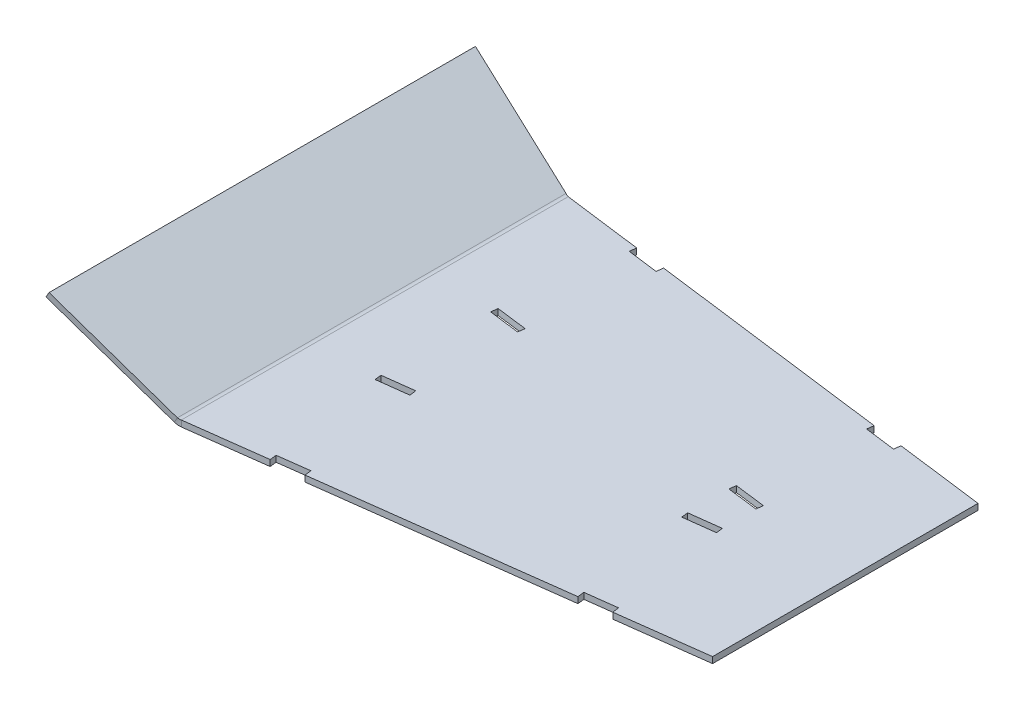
ISO-10303-21;
HEADER;
FILE_DESCRIPTION(('STEP AP214'),'2;1');
FILE_NAME('part.step','',(''),(''),'','','');
FILE_SCHEMA(('AUTOMOTIVE_DESIGN { 1 0 10303 214 1 1 1 1 }'));
ENDSEC;
DATA;
#1=APPLICATION_CONTEXT('core data for automotive mechanical design processes');
#2=APPLICATION_PROTOCOL_DEFINITION('international standard','automotive_design',2000,#1);
#3=PRODUCT_CONTEXT('',#1,'mechanical');
#4=PRODUCT('Part','Part','',(#3));
#5=PRODUCT_RELATED_PRODUCT_CATEGORY('part','',(#4));
#6=PRODUCT_DEFINITION_FORMATION('','',#4);
#7=PRODUCT_DEFINITION_CONTEXT('part definition',#1,'design');
#8=PRODUCT_DEFINITION('design','',#6,#7);
#9=PRODUCT_DEFINITION_SHAPE('','',#8);
#10=(LENGTH_UNIT() NAMED_UNIT(*) SI_UNIT(.MILLI.,.METRE.));
#11=(NAMED_UNIT(*) PLANE_ANGLE_UNIT() SI_UNIT($,.RADIAN.));
#12=(NAMED_UNIT(*) SI_UNIT($,.STERADIAN.) SOLID_ANGLE_UNIT());
#13=UNCERTAINTY_MEASURE_WITH_UNIT(LENGTH_MEASURE(1.E-05),#10,'distance_accuracy_value','');
#14=(GEOMETRIC_REPRESENTATION_CONTEXT(3) GLOBAL_UNCERTAINTY_ASSIGNED_CONTEXT((#13)) GLOBAL_UNIT_ASSIGNED_CONTEXT((#10,
#11,#12)) REPRESENTATION_CONTEXT('',''));
#15=CARTESIAN_POINT('',(0.,0.,0.));
#16=DIRECTION('',(0.,0.,1.));
#17=DIRECTION('',(1.,0.,0.));
#18=AXIS2_PLACEMENT_3D('',#15,#16,#17);
#19=CARTESIAN_POINT('',(-155.3,0.,-33.341673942));
#20=DIRECTION('',(-0.500000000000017,-0.866025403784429,0.));
#21=DIRECTION('',(0.866025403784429,-0.500000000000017,0.));
#22=AXIS2_PLACEMENT_3D('',#19,#20,#21);
#23=PLANE('',#22);
#24=DIRECTION('',(0.,0.,1.));
#25=VECTOR('',#24,1.);
#26=CARTESIAN_POINT('',(-156.2282032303,0.535898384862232,-63.69233419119));
#27=LINE('',#26,#25);
#28=CARTESIAN_POINT('',(-156.228203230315,0.535898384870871,63.6923341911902));
#29=VERTEX_POINT('',#28);
#30=CARTESIAN_POINT('',(-156.228203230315,0.535898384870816,-63.6923341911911));
#31=VERTEX_POINT('',#30);
#32=EDGE_CURVE('E275',#29,#31,#27,.F.);
#33=ORIENTED_EDGE('',*,*,#32,.F.);
#34=DIRECTION('',(0.856512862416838,-0.49450793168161,-0.147809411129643));
#35=VECTOR('',#34,1.);
#36=CARTESIAN_POINT('',(-192.106079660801,21.2500000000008,69.88382064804));
#37=LINE('',#36,#35);
#38=CARTESIAN_POINT('',(-192.1060796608,21.2500000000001,69.8838206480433));
#39=VERTEX_POINT('',#38);
#40=EDGE_CURVE('E295',#39,#29,#37,.T.);
#41=ORIENTED_EDGE('',*,*,#40,.F.);
#42=DIRECTION('',(0.,0.,1.));
#43=VECTOR('',#42,1.);
#44=CARTESIAN_POINT('',(-192.106079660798,21.2499999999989,0.));
#45=LINE('',#44,#43);
#46=CARTESIAN_POINT('',(-192.106079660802,21.2499999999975,-69.8838206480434));
#47=VERTEX_POINT('',#46);
#48=EDGE_CURVE('E277',#47,#39,#45,.T.);
#49=ORIENTED_EDGE('',*,*,#48,.F.);
#50=DIRECTION('',(-0.856512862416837,0.49450793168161,-0.147809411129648));
#51=VECTOR('',#50,1.);
#52=CARTESIAN_POINT('',(-156.2282032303,0.535898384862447,-63.6923341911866));
#53=LINE('',#52,#51);
#54=EDGE_CURVE('E272',#31,#47,#53,.T.);
#55=ORIENTED_EDGE('',*,*,#54,.F.);
#56=EDGE_LOOP('',(#33,#41,#49,#55));
#57=FACE_BOUND('',#56,.T.);
#58=ADVANCED_FACE('F16',(#57),#23,.T.);
#59=CARTESIAN_POINT('',(-191.6060796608,22.11602540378,0.));
#60=DIRECTION('',(-0.866025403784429,0.500000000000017,0.));
#61=DIRECTION('',(-0.500000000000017,-0.866025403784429,0.));
#62=AXIS2_PLACEMENT_3D('',#59,#60,#61);
#63=PLANE('',#62);
#64=DIRECTION('',(0.499999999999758,0.866025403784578,0.));
#65=VECTOR('',#64,1.);
#66=CARTESIAN_POINT('',(-192.106079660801,21.2500000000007,-69.8838206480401));
#67=LINE('',#66,#65);
#68=CARTESIAN_POINT('',(-191.106079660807,22.9820508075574,-69.8838206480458));
#69=VERTEX_POINT('',#68);
#70=EDGE_CURVE('E283',#47,#69,#67,.T.);
#71=ORIENTED_EDGE('',*,*,#70,.F.);
#72=ORIENTED_EDGE('',*,*,#48,.T.);
#73=DIRECTION('',(-0.499999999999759,-0.866025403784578,0.));
#74=VECTOR('',#73,1.);
#75=CARTESIAN_POINT('',(-191.106079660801,22.9820508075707,69.88382064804));
#76=LINE('',#75,#74);
#77=CARTESIAN_POINT('',(-191.10607966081,22.9820508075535,69.8838206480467));
#78=VERTEX_POINT('',#77);
#79=EDGE_CURVE('E282',#78,#39,#76,.T.);
#80=ORIENTED_EDGE('',*,*,#79,.F.);
#81=DIRECTION('',(0.,0.,1.));
#82=VECTOR('',#81,1.);
#83=CARTESIAN_POINT('',(-191.10607966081,22.9820508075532,-33.341673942));
#84=LINE('',#83,#82);
#85=EDGE_CURVE('E359',#78,#69,#84,.F.);
#86=ORIENTED_EDGE('',*,*,#85,.T.);
#87=EDGE_LOOP('',(#71,#72,#80,#86));
#88=FACE_BOUND('',#87,.T.);
#89=ADVANCED_FACE('F417',(#88),#63,.T.);
#90=CARTESIAN_POINT('',(-173.6671414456,11.75897459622,-66.78807741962));
#91=DIRECTION('',(0.128006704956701,-0.0739047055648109,-0.989015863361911));
#92=DIRECTION('',(-0.991727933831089,0.,-0.128357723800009));
#93=AXIS2_PLACEMENT_3D('',#90,#91,#92);
#94=PLANE('',#93);
#95=DIRECTION('',(-0.499999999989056,-0.866025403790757,0.));
#96=VECTOR('',#95,1.);
#97=CARTESIAN_POINT('',(-155.728203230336,1.40192378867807,-63.6923341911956));
#98=LINE('',#97,#96);
#99=CARTESIAN_POINT('',(-155.228203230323,2.26794919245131,-63.6923341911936));
#100=VERTEX_POINT('',#99);
#101=EDGE_CURVE('E299',#100,#31,#98,.T.);
#102=ORIENTED_EDGE('',*,*,#101,.T.);
#103=ORIENTED_EDGE('',*,*,#54,.T.);
#104=ORIENTED_EDGE('',*,*,#70,.T.);
#105=DIRECTION('',(0.856512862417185,-0.494507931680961,0.147809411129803));
#106=VECTOR('',#105,1.);
#107=CARTESIAN_POINT('',(-191.10607966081,22.9820508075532,-69.88382064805));
#108=LINE('',#107,#106);
#109=EDGE_CURVE('E302',#69,#100,#108,.T.);
#110=ORIENTED_EDGE('',*,*,#109,.T.);
#111=EDGE_LOOP('',(#102,#103,#104,#110));
#112=FACE_BOUND('',#111,.T.);
#113=ADVANCED_FACE('F300',(#112),#94,.T.);
#114=CARTESIAN_POINT('',(-173.6671414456,11.75897459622,66.78807741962));
#115=DIRECTION('',(0.128006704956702,-0.0739047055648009,0.989015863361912));
#116=DIRECTION('',(0.991727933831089,0.,-0.128357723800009));
#117=AXIS2_PLACEMENT_3D('',#114,#115,#116);
#118=PLANE('',#117);
#119=ORIENTED_EDGE('',*,*,#79,.T.);
#120=ORIENTED_EDGE('',*,*,#40,.T.);
#121=DIRECTION('',(-0.499999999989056,-0.866025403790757,0.));
#122=VECTOR('',#121,1.);
#123=CARTESIAN_POINT('',(-155.728203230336,1.40192378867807,63.6923341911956));
#124=LINE('',#123,#122);
#125=CARTESIAN_POINT('',(-155.228203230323,2.26794919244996,63.692334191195));
#126=VERTEX_POINT('',#125);
#127=EDGE_CURVE('E340',#126,#29,#124,.T.);
#128=ORIENTED_EDGE('',*,*,#127,.F.);
#129=DIRECTION('',(-0.856512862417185,0.494507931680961,0.147809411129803));
#130=VECTOR('',#129,1.);
#131=CARTESIAN_POINT('',(-155.228203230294,2.2679491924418,63.69233419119));
#132=LINE('',#131,#130);
#133=EDGE_CURVE('E304',#126,#78,#132,.T.);
#134=ORIENTED_EDGE('',*,*,#133,.T.);
#135=EDGE_LOOP('',(#119,#120,#128,#134));
#136=FACE_BOUND('',#135,.T.);
#137=ADVANCED_FACE('F330',(#136),#118,.T.);
#138=CARTESIAN_POINT('',(-154.2282032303,4.,-63.69233419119));
#139=DIRECTION('',(0.,0.,1.));
#140=DIRECTION('',(1.,0.,0.));
#141=AXIS2_PLACEMENT_3D('',#138,#139,#140);
#142=CYLINDRICAL_SURFACE('',#141,4.);
#143=CARTESIAN_POINT('',(-154.2282032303,0.,63.39390198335));
#144=CARTESIAN_POINT('',(-154.271836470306,-2.74426709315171E-07,63.4001193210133));
#145=CARTESIAN_POINT('',(-154.315469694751,0.000713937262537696,63.4063366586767));
#146=CARTESIAN_POINT('',(-154.402689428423,0.00356936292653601,63.4187713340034));
#147=CARTESIAN_POINT('',(-154.446275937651,0.00571057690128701,63.4249886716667));
#148=CARTESIAN_POINT('',(-154.53335555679,0.0114180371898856,63.4374233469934));
#149=CARTESIAN_POINT('',(-154.576848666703,0.0149842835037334,63.4436406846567));
#150=CARTESIAN_POINT('',(-154.663694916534,0.0235379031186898,63.4560753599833));
#151=CARTESIAN_POINT('',(-154.707048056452,0.0285252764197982,63.4622926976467));
#152=CARTESIAN_POINT('',(-154.793567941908,0.0399158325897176,63.4747273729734));
#153=CARTESIAN_POINT('',(-154.836734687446,0.0463190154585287,63.4809447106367));
#154=CARTESIAN_POINT('',(-154.922835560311,0.0605343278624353,63.4933793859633));
#155=CARTESIAN_POINT('',(-154.965769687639,0.0683464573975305,63.4995967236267));
#156=CARTESIAN_POINT('',(-155.05135934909,0.0853712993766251,63.5120313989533));
#157=CARTESIAN_POINT('',(-155.094014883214,0.0945840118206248,63.5182487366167));
#158=CARTESIAN_POINT('',(-155.179001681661,0.1144001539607,63.5306834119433));
#159=CARTESIAN_POINT('',(-155.221332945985,0.125003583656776,63.5369007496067));
#160=CARTESIAN_POINT('',(-155.305625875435,0.147589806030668,63.5493354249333));
#161=CARTESIAN_POINT('',(-155.347587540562,0.159572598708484,63.5555527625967));
#162=CARTESIAN_POINT('',(-155.431096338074,0.184904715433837,63.5679874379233));
#163=CARTESIAN_POINT('',(-155.472643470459,0.198254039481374,63.5742047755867));
#164=CARTESIAN_POINT('',(-155.555278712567,0.226304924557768,63.5866394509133));
#165=CARTESIAN_POINT('',(-155.596366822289,0.241006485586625,63.5928567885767));
#166=CARTESIAN_POINT('',(-155.678040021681,0.271746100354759,63.6052914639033));
#167=CARTESIAN_POINT('',(-155.718625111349,0.287784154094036,63.6115088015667));
#168=CARTESIAN_POINT('',(-155.799248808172,0.321179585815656,63.6239434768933));
#169=CARTESIAN_POINT('',(-155.839287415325,0.338536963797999,63.6301608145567));
#170=CARTESIAN_POINT('',(-155.91877528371,0.37455243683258,63.6425954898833));
#171=CARTESIAN_POINT('',(-155.95822454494,0.393210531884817,63.6488128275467));
#172=CARTESIAN_POINT('',(-156.036491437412,0.431807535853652,63.6612475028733));
#173=CARTESIAN_POINT('',(-156.075309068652,0.451746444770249,63.6674648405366));
#174=CARTESIAN_POINT('',(-156.152271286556,0.492883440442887,63.6798995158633));
#175=CARTESIAN_POINT('',(-156.190415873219,0.514081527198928,63.6861168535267));
#176=CARTESIAN_POINT('',(-156.2282032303,0.535898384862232,63.69233419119));
#177=B_SPLINE_CURVE_WITH_KNOTS('',3,(#143,#144,#145,#146,#147,#148,#149,#150,#151,#152,#153,
#154,#155,#156,#157,#158,#159,#160,#161,#162,#163,#164,#165,#166,#167,#168,#169,#170,#171,#172,
#173,#174,#175,#176),.UNSPECIFIED.,.F.,.F.,(4,2,2,2,2,2,2,2,2,2,2,2,2,2,2,2,4),(0.,
0.132216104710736,0.264432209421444,0.396648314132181,0.528864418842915,0.661080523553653,
0.793296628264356,0.925512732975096,1.05772883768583,1.18994494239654,1.32216104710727,
1.454377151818,1.58659325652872,1.71880936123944,1.85102546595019,1.98324157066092,
2.11545767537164),.UNSPECIFIED.);
#178=CARTESIAN_POINT('',(-154.2282032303,0.,63.3939019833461));
#179=VERTEX_POINT('',#178);
#180=EDGE_CURVE('E293',#29,#179,#177,.F.);
#181=ORIENTED_EDGE('',*,*,#180,.F.);
#182=ORIENTED_EDGE('',*,*,#32,.T.);
#183=CARTESIAN_POINT('',(-156.2282032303,0.535898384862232,-63.69233419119));
#184=CARTESIAN_POINT('',(-156.190415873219,0.514081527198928,-63.6861168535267));
#185=CARTESIAN_POINT('',(-156.152271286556,0.492883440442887,-63.6798995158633));
#186=CARTESIAN_POINT('',(-156.075309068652,0.451746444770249,-63.6674648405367));
#187=CARTESIAN_POINT('',(-156.036491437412,0.431807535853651,-63.6612475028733));
#188=CARTESIAN_POINT('',(-155.95822454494,0.393210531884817,-63.6488128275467));
#189=CARTESIAN_POINT('',(-155.91877528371,0.37455243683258,-63.6425954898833));
#190=CARTESIAN_POINT('',(-155.839287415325,0.338536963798,-63.6301608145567));
#191=CARTESIAN_POINT('',(-155.799248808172,0.321179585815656,-63.6239434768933));
#192=CARTESIAN_POINT('',(-155.718625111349,0.287784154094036,-63.6115088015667));
#193=CARTESIAN_POINT('',(-155.678040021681,0.271746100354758,-63.6052914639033));
#194=CARTESIAN_POINT('',(-155.596366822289,0.241006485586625,-63.5928567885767));
#195=CARTESIAN_POINT('',(-155.555278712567,0.226304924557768,-63.5866394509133));
#196=CARTESIAN_POINT('',(-155.472643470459,0.198254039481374,-63.5742047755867));
#197=CARTESIAN_POINT('',(-155.431096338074,0.184904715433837,-63.5679874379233));
#198=CARTESIAN_POINT('',(-155.347587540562,0.159572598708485,-63.5555527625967));
#199=CARTESIAN_POINT('',(-155.305625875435,0.147589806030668,-63.5493354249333));
#200=CARTESIAN_POINT('',(-155.221332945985,0.125003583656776,-63.5369007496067));
#201=CARTESIAN_POINT('',(-155.179001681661,0.1144001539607,-63.5306834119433));
#202=CARTESIAN_POINT('',(-155.094014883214,0.0945840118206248,-63.5182487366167));
#203=CARTESIAN_POINT('',(-155.05135934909,0.085371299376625,-63.5120313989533));
#204=CARTESIAN_POINT('',(-154.965769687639,0.0683464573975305,-63.4995967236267));
#205=CARTESIAN_POINT('',(-154.922835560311,0.0605343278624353,-63.4933793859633));
#206=CARTESIAN_POINT('',(-154.836734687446,0.0463190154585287,-63.4809447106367));
#207=CARTESIAN_POINT('',(-154.793567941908,0.0399158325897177,-63.4747273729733));
#208=CARTESIAN_POINT('',(-154.707048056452,0.0285252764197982,-63.4622926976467));
#209=CARTESIAN_POINT('',(-154.663694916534,0.0235379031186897,-63.4560753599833));
#210=CARTESIAN_POINT('',(-154.576848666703,0.0149842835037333,-63.4436406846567));
#211=CARTESIAN_POINT('',(-154.53335555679,0.0114180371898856,-63.4374233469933));
#212=CARTESIAN_POINT('',(-154.446275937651,0.00571057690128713,-63.4249886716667));
#213=CARTESIAN_POINT('',(-154.402689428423,0.00356936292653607,-63.4187713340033));
#214=CARTESIAN_POINT('',(-154.315469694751,0.000713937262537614,-63.4063366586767));
#215=CARTESIAN_POINT('',(-154.271836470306,-2.74426709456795E-07,-63.4001193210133));
#216=CARTESIAN_POINT('',(-154.2282032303,0.,-63.39390198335));
#217=B_SPLINE_CURVE_WITH_KNOTS('',3,(#183,#184,#185,#186,#187,#188,#189,#190,#191,#192,#193,
#194,#195,#196,#197,#198,#199,#200,#201,#202,#203,#204,#205,#206,#207,#208,#209,#210,#211,#212,
#213,#214,#215,#216),.UNSPECIFIED.,.F.,.F.,(4,2,2,2,2,2,2,2,2,2,2,2,2,2,2,2,4),(0.,
0.132216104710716,0.264432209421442,0.396648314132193,0.528864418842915,0.66108052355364,
0.793296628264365,0.925512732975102,1.05772883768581,1.18994494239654,1.32216104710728,
1.45437715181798,1.58659325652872,1.71880936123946,1.8510254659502,1.9832415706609,
2.11545767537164),.UNSPECIFIED.);
#218=CARTESIAN_POINT('',(-154.2282032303,0.,-63.3939019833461));
#219=VERTEX_POINT('',#218);
#220=EDGE_CURVE('E290',#31,#219,#217,.T.);
#221=ORIENTED_EDGE('',*,*,#220,.T.);
#222=DIRECTION('',(0.,0.,1.));
#223=VECTOR('',#222,1.);
#224=CARTESIAN_POINT('',(-154.2282032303,0.,0.));
#225=LINE('',#224,#223);
#226=EDGE_CURVE('E339',#219,#179,#225,.T.);
#227=ORIENTED_EDGE('',*,*,#226,.T.);
#228=EDGE_LOOP('',(#181,#182,#221,#227));
#229=FACE_BOUND('',#228,.T.);
#230=ADVANCED_FACE('F288',(#229),#142,.T.);
#231=CARTESIAN_POINT('',(-156.8863152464,0.6231346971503,-63.77397878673));
#232=CARTESIAN_POINT('',(-156.3511765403,1.302974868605,-63.77397878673));
#233=CARTESIAN_POINT('',(-155.8160378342,1.982815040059,-63.77397878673));
#234=CARTESIAN_POINT('',(-155.2808991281,2.662655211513,-63.77397878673));
#235=CARTESIAN_POINT('',(-156.7252333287,0.495891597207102,-63.74676392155));
#236=CARTESIAN_POINT('',(-156.2225240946,1.201348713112,-63.74676392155));
#237=CARTESIAN_POINT('',(-155.7198148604,1.906805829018,-63.74676392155));
#238=CARTESIAN_POINT('',(-155.2171056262,2.612262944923,-63.74676392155));
#239=CARTESIAN_POINT('',(-156.3473089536,0.2399500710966,-63.68638992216));
#240=CARTESIAN_POINT('',(-155.9206845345,0.996934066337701,-63.68638992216));
#241=CARTESIAN_POINT('',(-155.4940601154,1.753918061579,-63.68638992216));
#242=CARTESIAN_POINT('',(-155.0674356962,2.51090205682,-63.68638992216));
#243=CARTESIAN_POINT('',(-155.7056533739,-0.0592586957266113,-63.59285678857));
#244=CARTESIAN_POINT('',(-155.4082088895,0.7579628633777,-63.59285678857));
#245=CARTESIAN_POINT('',(-155.1107644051,1.575184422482,-63.59285678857));
#246=CARTESIAN_POINT('',(-154.8133199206,2.392405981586,-63.59285678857));
#247=CARTESIAN_POINT('',(-154.9783232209,-0.254146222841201,-63.49337938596));
#248=CARTESIAN_POINT('',(-154.8273069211,0.602310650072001,-63.49337938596));
#249=CARTESIAN_POINT('',(-154.6762906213,1.458767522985,-63.49337938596));
#250=CARTESIAN_POINT('',(-154.5252743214,2.315224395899,-63.49337938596));
#251=CARTESIAN_POINT('',(-154.273028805,-0.315851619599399,-63.39984625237));
#252=CARTESIAN_POINT('',(-154.2640043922,0.553027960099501,-63.39984625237));
#253=CARTESIAN_POINT('',(-154.2549799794,1.421907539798,-63.39984625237));
#254=CARTESIAN_POINT('',(-154.2459555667,2.290787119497,-63.39984625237));
#255=CARTESIAN_POINT('',(-153.8177659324,-0.2831619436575,-63.33947225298));
#256=CARTESIAN_POINT('',(-153.9003963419,0.579136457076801,-63.33947225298));
#257=CARTESIAN_POINT('',(-153.9830267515,1.441434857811,-63.33947225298));
#258=CARTESIAN_POINT('',(-154.065657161,2.303733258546,-63.33947225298));
#259=CARTESIAN_POINT('',(-153.6146433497,-0.253507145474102,-63.3122573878));
#260=CARTESIAN_POINT('',(-153.7381669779,0.6028210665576,-63.3122573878));
#261=CARTESIAN_POINT('',(-153.8616906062,1.459149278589,-63.3122573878));
#262=CARTESIAN_POINT('',(-153.9852142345,2.315477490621,-63.3122573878));
#263=B_SPLINE_SURFACE_WITH_KNOTS('',3,3,((#231,#232,#233,#234),(#235,#236,#237,#238),(#239,#240,
#241,#242),(#243,#244,#245,#246),(#247,#248,#249,#250),(#251,#252,#253,#254),(#255,#256,#257,
#258),(#259,#260,#261,#262)),.UNSPECIFIED.,.F.,.F.,.F.,(4,1,1,1,1,4),(4,4),(-0.2735783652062,0.,
0.3333333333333,0.6666666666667,1.,1.273578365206),(-0.1489487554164,1.148948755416),.UNSPECIFIED.);
#264=CARTESIAN_POINT('',(-155.2282032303,2.26794919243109,-63.69233419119));
#265=CARTESIAN_POINT('',(-155.209309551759,2.25704076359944,-63.6861168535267));
#266=CARTESIAN_POINT('',(-155.190237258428,2.24644172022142,-63.6798995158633));
#267=CARTESIAN_POINT('',(-155.151756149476,2.2258732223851,-63.6674648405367));
#268=CARTESIAN_POINT('',(-155.132347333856,2.21590376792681,-63.6612475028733));
#269=CARTESIAN_POINT('',(-155.09321388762,2.19660526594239,-63.6488128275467));
#270=CARTESIAN_POINT('',(-155.073489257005,2.18727621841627,-63.6425954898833));
#271=CARTESIAN_POINT('',(-155.033745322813,2.16926848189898,-63.6301608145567));
#272=CARTESIAN_POINT('',(-155.013726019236,2.16058979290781,-63.6239434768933));
#273=CARTESIAN_POINT('',(-154.973414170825,2.143892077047,-63.6115088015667));
#274=CARTESIAN_POINT('',(-154.95312162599,2.13587305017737,-63.6052914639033));
#275=CARTESIAN_POINT('',(-154.912285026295,2.1205032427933,-63.5928567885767));
#276=CARTESIAN_POINT('',(-154.891740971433,2.11315246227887,-63.5866394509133));
#277=CARTESIAN_POINT('',(-154.850423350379,2.09912701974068,-63.5742047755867));
#278=CARTESIAN_POINT('',(-154.829649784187,2.09245235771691,-63.5679874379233));
#279=CARTESIAN_POINT('',(-154.787895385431,2.07978629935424,-63.5555527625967));
#280=CARTESIAN_POINT('',(-154.766914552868,2.07379490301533,-63.5493354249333));
#281=CARTESIAN_POINT('',(-154.724768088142,2.06250179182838,-63.5369007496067));
#282=CARTESIAN_POINT('',(-154.703602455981,2.05720007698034,-63.5306834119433));
#283=CARTESIAN_POINT('',(-154.661109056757,2.04729200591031,-63.5182487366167));
#284=CARTESIAN_POINT('',(-154.639781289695,2.04268564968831,-63.5120313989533));
#285=CARTESIAN_POINT('',(-154.596986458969,2.03417322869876,-63.4995967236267));
#286=CARTESIAN_POINT('',(-154.575519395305,2.03026716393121,-63.4933793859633));
#287=CARTESIAN_POINT('',(-154.532468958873,2.02315950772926,-63.4809447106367));
#288=CARTESIAN_POINT('',(-154.510885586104,2.01995791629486,-63.4747273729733));
#289=CARTESIAN_POINT('',(-154.467625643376,2.0142626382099,-63.4622926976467));
#290=CARTESIAN_POINT('',(-154.445949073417,2.01176895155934,-63.4560753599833));
#291=CARTESIAN_POINT('',(-154.402525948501,2.00749214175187,-63.4436406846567));
#292=CARTESIAN_POINT('',(-154.380779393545,2.00570901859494,-63.4374233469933));
#293=CARTESIAN_POINT('',(-154.337239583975,2.00285528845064,-63.4249886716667));
#294=CARTESIAN_POINT('',(-154.315446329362,2.00178468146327,-63.4187713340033));
#295=CARTESIAN_POINT('',(-154.271836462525,2.00035696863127,-63.4063366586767));
#296=CARTESIAN_POINT('',(-154.250019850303,1.99999986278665,-63.4001193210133));
#297=CARTESIAN_POINT('',(-154.2282032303,2.,-63.39390198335));
#298=B_SPLINE_CURVE_WITH_KNOTS('',3,(#264,#265,#266,#267,#268,#269,#270,#271,#272,#273,#274,
#275,#276,#277,#278,#279,#280,#281,#282,#283,#284,#285,#286,#287,#288,#289,#290,#291,#292,#293,
#294,#295,#296,#297),.UNSPECIFIED.,.F.,.F.,(4,2,2,2,2,2,2,2,2,2,2,2,2,2,2,2,4),(0.,
0.0680529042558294,0.136105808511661,0.204158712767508,0.272211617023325,0.340264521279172,
0.408317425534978,0.476370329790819,0.544423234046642,0.612476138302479,0.680529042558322,
0.748581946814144,0.816634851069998,0.884687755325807,0.952740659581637,1.02079356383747,
1.08884646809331),.UNSPECIFIED.);
#299=CARTESIAN_POINT('',(-154.2282032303,2.,-63.3939019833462));
#300=VERTEX_POINT('',#299);
#301=EDGE_CURVE('E305',#300,#100,#298,.F.);
#302=DIRECTION('',(0.,1.,0.));
#303=VECTOR('',#302,1.);
#304=CARTESIAN_POINT('',(-154.228203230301,1.,-63.3939019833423));
#305=LINE('',#304,#303);
#306=EDGE_CURVE('E310',#219,#300,#305,.T.);
#307=ORIENTED_EDGE('',*,*,#301,.F.);
#308=ORIENTED_EDGE('',*,*,#306,.F.);
#309=ORIENTED_EDGE('',*,*,#220,.F.);
#310=ORIENTED_EDGE('',*,*,#101,.F.);
#311=EDGE_LOOP('',(#307,#308,#309,#310));
#312=FACE_BOUND('',#311,.T.);
#313=ADVANCED_FACE('F308',(#312),#263,.F.);
#314=CARTESIAN_POINT('',(-154.3,1.732050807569,-33.341673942));
#315=DIRECTION('',(-0.500000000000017,-0.866025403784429,0.));
#316=DIRECTION('',(0.866025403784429,-0.500000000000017,0.));
#317=AXIS2_PLACEMENT_3D('',#314,#315,#316);
#318=PLANE('',#317);
#319=ORIENTED_EDGE('',*,*,#109,.F.);
#320=ORIENTED_EDGE('',*,*,#85,.F.);
#321=ORIENTED_EDGE('',*,*,#133,.F.);
#322=DIRECTION('',(0.,0.,1.));
#323=VECTOR('',#322,1.);
#324=CARTESIAN_POINT('',(-155.2282032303,2.26794919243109,-63.69233419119));
#325=LINE('',#324,#323);
#326=EDGE_CURVE('E364',#126,#100,#325,.F.);
#327=ORIENTED_EDGE('',*,*,#326,.T.);
#328=EDGE_LOOP('',(#319,#320,#321,#327));
#329=FACE_BOUND('',#328,.T.);
#330=ADVANCED_FACE('F331',(#329),#318,.F.);
#331=CARTESIAN_POINT('',(-156.8863152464,0.6231346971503,63.77397878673));
#332=CARTESIAN_POINT('',(-156.3511765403,1.302974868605,63.77397878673));
#333=CARTESIAN_POINT('',(-155.8160378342,1.982815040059,63.77397878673));
#334=CARTESIAN_POINT('',(-155.2808991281,2.662655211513,63.77397878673));
#335=CARTESIAN_POINT('',(-156.7252333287,0.495891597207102,63.74676392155));
#336=CARTESIAN_POINT('',(-156.2225240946,1.201348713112,63.74676392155));
#337=CARTESIAN_POINT('',(-155.7198148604,1.906805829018,63.74676392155));
#338=CARTESIAN_POINT('',(-155.2171056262,2.612262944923,63.74676392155));
#339=CARTESIAN_POINT('',(-156.3473089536,0.2399500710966,63.68638992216));
#340=CARTESIAN_POINT('',(-155.9206845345,0.996934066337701,63.68638992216));
#341=CARTESIAN_POINT('',(-155.4940601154,1.753918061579,63.68638992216));
#342=CARTESIAN_POINT('',(-155.0674356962,2.51090205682,63.68638992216));
#343=CARTESIAN_POINT('',(-155.7056533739,-0.0592586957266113,63.59285678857));
#344=CARTESIAN_POINT('',(-155.4082088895,0.7579628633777,63.59285678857));
#345=CARTESIAN_POINT('',(-155.1107644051,1.575184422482,63.59285678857));
#346=CARTESIAN_POINT('',(-154.8133199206,2.392405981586,63.59285678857));
#347=CARTESIAN_POINT('',(-154.9783232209,-0.254146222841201,63.49337938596));
#348=CARTESIAN_POINT('',(-154.8273069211,0.602310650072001,63.49337938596));
#349=CARTESIAN_POINT('',(-154.6762906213,1.458767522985,63.49337938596));
#350=CARTESIAN_POINT('',(-154.5252743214,2.315224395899,63.49337938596));
#351=CARTESIAN_POINT('',(-154.273028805,-0.315851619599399,63.39984625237));
#352=CARTESIAN_POINT('',(-154.2640043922,0.553027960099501,63.39984625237));
#353=CARTESIAN_POINT('',(-154.2549799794,1.421907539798,63.39984625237));
#354=CARTESIAN_POINT('',(-154.2459555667,2.290787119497,63.39984625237));
#355=CARTESIAN_POINT('',(-153.8177659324,-0.2831619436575,63.33947225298));
#356=CARTESIAN_POINT('',(-153.9003963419,0.579136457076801,63.33947225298));
#357=CARTESIAN_POINT('',(-153.9830267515,1.441434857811,63.33947225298));
#358=CARTESIAN_POINT('',(-154.065657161,2.303733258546,63.33947225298));
#359=CARTESIAN_POINT('',(-153.6146433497,-0.253507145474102,63.3122573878));
#360=CARTESIAN_POINT('',(-153.7381669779,0.6028210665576,63.3122573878));
#361=CARTESIAN_POINT('',(-153.8616906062,1.459149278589,63.3122573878));
#362=CARTESIAN_POINT('',(-153.9852142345,2.315477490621,63.3122573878));
#363=B_SPLINE_SURFACE_WITH_KNOTS('',3,3,((#331,#332,#333,#334),(#335,#336,#337,#338),(#339,#340,
#341,#342),(#343,#344,#345,#346),(#347,#348,#349,#350),(#351,#352,#353,#354),(#355,#356,#357,
#358),(#359,#360,#361,#362)),.UNSPECIFIED.,.F.,.F.,.F.,(4,1,1,1,1,4),(4,4),(-0.2735783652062,0.,
0.3333333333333,0.6666666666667,1.,1.273578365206),(-0.1489487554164,1.148948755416),.UNSPECIFIED.);
#364=DIRECTION('',(0.,1.,0.));
#365=VECTOR('',#364,1.);
#366=CARTESIAN_POINT('',(-154.228203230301,1.,63.3939019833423));
#367=LINE('',#366,#365);
#368=CARTESIAN_POINT('',(-154.228203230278,1.99999999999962,63.39390198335));
#369=VERTEX_POINT('',#368);
#370=EDGE_CURVE('E350',#369,#179,#367,.F.);
#371=CARTESIAN_POINT('',(-154.2282032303,2.,63.39390198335));
#372=CARTESIAN_POINT('',(-154.250019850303,1.99999986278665,63.4001193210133));
#373=CARTESIAN_POINT('',(-154.271836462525,2.00035696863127,63.4063366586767));
#374=CARTESIAN_POINT('',(-154.315446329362,2.00178468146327,63.4187713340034));
#375=CARTESIAN_POINT('',(-154.337239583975,2.00285528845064,63.4249886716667));
#376=CARTESIAN_POINT('',(-154.380779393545,2.00570901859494,63.4374233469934));
#377=CARTESIAN_POINT('',(-154.402525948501,2.00749214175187,63.4436406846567));
#378=CARTESIAN_POINT('',(-154.445949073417,2.01176895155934,63.4560753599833));
#379=CARTESIAN_POINT('',(-154.467625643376,2.0142626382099,63.4622926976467));
#380=CARTESIAN_POINT('',(-154.510885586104,2.01995791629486,63.4747273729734));
#381=CARTESIAN_POINT('',(-154.532468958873,2.02315950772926,63.4809447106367));
#382=CARTESIAN_POINT('',(-154.575519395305,2.03026716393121,63.4933793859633));
#383=CARTESIAN_POINT('',(-154.596986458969,2.03417322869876,63.4995967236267));
#384=CARTESIAN_POINT('',(-154.639781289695,2.04268564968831,63.5120313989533));
#385=CARTESIAN_POINT('',(-154.661109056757,2.04729200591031,63.5182487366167));
#386=CARTESIAN_POINT('',(-154.703602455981,2.05720007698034,63.5306834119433));
#387=CARTESIAN_POINT('',(-154.724768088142,2.06250179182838,63.5369007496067));
#388=CARTESIAN_POINT('',(-154.766914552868,2.07379490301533,63.5493354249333));
#389=CARTESIAN_POINT('',(-154.787895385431,2.07978629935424,63.5555527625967));
#390=CARTESIAN_POINT('',(-154.829649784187,2.09245235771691,63.5679874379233));
#391=CARTESIAN_POINT('',(-154.850423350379,2.09912701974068,63.5742047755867));
#392=CARTESIAN_POINT('',(-154.891740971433,2.11315246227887,63.5866394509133));
#393=CARTESIAN_POINT('',(-154.912285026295,2.1205032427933,63.5928567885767));
#394=CARTESIAN_POINT('',(-154.95312162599,2.13587305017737,63.6052914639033));
#395=CARTESIAN_POINT('',(-154.973414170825,2.143892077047,63.6115088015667));
#396=CARTESIAN_POINT('',(-155.013726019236,2.16058979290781,63.6239434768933));
#397=CARTESIAN_POINT('',(-155.033745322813,2.16926848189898,63.6301608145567));
#398=CARTESIAN_POINT('',(-155.073489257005,2.18727621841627,63.6425954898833));
#399=CARTESIAN_POINT('',(-155.09321388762,2.19660526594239,63.6488128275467));
#400=CARTESIAN_POINT('',(-155.132347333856,2.21590376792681,63.6612475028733));
#401=CARTESIAN_POINT('',(-155.151756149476,2.2258732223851,63.6674648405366));
#402=CARTESIAN_POINT('',(-155.190237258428,2.24644172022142,63.6798995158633));
#403=CARTESIAN_POINT('',(-155.209309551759,2.25704076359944,63.6861168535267));
#404=CARTESIAN_POINT('',(-155.2282032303,2.26794919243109,63.69233419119));
#405=B_SPLINE_CURVE_WITH_KNOTS('',3,(#371,#372,#373,#374,#375,#376,#377,#378,#379,#380,#381,
#382,#383,#384,#385,#386,#387,#388,#389,#390,#391,#392,#393,#394,#395,#396,#397,#398,#399,#400,
#401,#402,#403,#404),.UNSPECIFIED.,.F.,.F.,(4,2,2,2,2,2,2,2,2,2,2,2,2,2,2,2,4),(0.,
0.0680529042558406,0.136105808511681,0.204158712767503,0.272211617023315,0.34026452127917,
0.408317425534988,0.476370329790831,0.544423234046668,0.612476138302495,0.680529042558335,
0.748581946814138,0.816634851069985,0.884687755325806,0.952740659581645,1.02079356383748,
1.08884646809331),.UNSPECIFIED.);
#406=EDGE_CURVE('E352',#369,#126,#405,.T.);
#407=ORIENTED_EDGE('',*,*,#127,.T.);
#408=ORIENTED_EDGE('',*,*,#180,.T.);
#409=ORIENTED_EDGE('',*,*,#370,.F.);
#410=ORIENTED_EDGE('',*,*,#406,.T.);
#411=EDGE_LOOP('',(#407,#408,#409,#410));
#412=FACE_BOUND('',#411,.T.);
#413=ADVANCED_FACE('F18',(#412),#363,.T.);
#414=CARTESIAN_POINT('',(0.,0.,0.));
#415=DIRECTION('',(0.,1.,0.));
#416=DIRECTION('',(0.,0.,1.));
#417=AXIS2_PLACEMENT_3D('',#414,#415,#416);
#418=PLANE('',#417);
#419=DIRECTION('',(0.992223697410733,0.,0.124467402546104));
#420=VECTOR('',#419,1.);
#421=CARTESIAN_POINT('',(-128.8866453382,0.,-19.51974211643));
#422=LINE('',#421,#420);
#423=CARTESIAN_POINT('',(-133.946986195,0.,-20.1545258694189));
#424=VERTEX_POINT('',#423);
#425=CARTESIAN_POINT('',(-123.8263044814,0.,-18.8849583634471));
#426=VERTEX_POINT('',#425);
#427=EDGE_CURVE('E667',#424,#426,#422,.T.);
#428=ORIENTED_EDGE('',*,*,#427,.F.);
#429=DIRECTION('',(0.124467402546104,0.,-0.992223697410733));
#430=VECTOR('',#429,1.);
#431=CARTESIAN_POINT('',(-134.0839003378,0.,-19.06307980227));
#432=LINE('',#431,#430);
#433=CARTESIAN_POINT('',(-134.2208144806,0.,-17.971633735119));
#434=VERTEX_POINT('',#433);
#435=EDGE_CURVE('E672',#434,#424,#432,.T.);
#436=ORIENTED_EDGE('',*,*,#435,.F.);
#437=DIRECTION('',(-0.992223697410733,0.,-0.124467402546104));
#438=VECTOR('',#437,1.);
#439=CARTESIAN_POINT('',(-129.1604736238,0.,-17.33684998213));
#440=LINE('',#439,#438);
#441=CARTESIAN_POINT('',(-124.100132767,0.,-16.7020662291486));
#442=VERTEX_POINT('',#441);
#443=EDGE_CURVE('E656',#442,#434,#440,.T.);
#444=ORIENTED_EDGE('',*,*,#443,.F.);
#445=DIRECTION('',(-0.124467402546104,0.,0.992223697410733));
#446=VECTOR('',#445,1.);
#447=CARTESIAN_POINT('',(-123.9632186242,0.,-17.7935122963));
#448=LINE('',#447,#446);
#449=EDGE_CURVE('E662',#426,#442,#448,.T.);
#450=ORIENTED_EDGE('',*,*,#449,.F.);
#451=EDGE_LOOP('',(#428,#436,#444,#450));
#452=FACE_BOUND('',#451,.T.);
#453=DIRECTION('',(-0.992223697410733,0.,0.124467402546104));
#454=VECTOR('',#453,1.);
#455=CARTESIAN_POINT('',(-39.58651257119,0.,8.317675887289));
#456=LINE('',#455,#454);
#457=CARTESIAN_POINT('',(-34.5261717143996,0.,7.68289213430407));
#458=VERTEX_POINT('',#457);
#459=CARTESIAN_POINT('',(-44.6468534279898,0.,8.95245964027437));
#460=VERTEX_POINT('',#459);
#461=EDGE_CURVE('E646',#458,#460,#456,.T.);
#462=ORIENTED_EDGE('',*,*,#461,.F.);
#463=DIRECTION('',(0.124467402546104,0.,0.992223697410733));
#464=VECTOR('',#463,1.);
#465=CARTESIAN_POINT('',(-34.6630858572,0.,6.591446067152));
#466=LINE('',#465,#464);
#467=CARTESIAN_POINT('',(-34.8000000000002,0.,5.50000000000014));
#468=VERTEX_POINT('',#467);
#469=EDGE_CURVE('E651',#468,#458,#466,.T.);
#470=ORIENTED_EDGE('',*,*,#469,.F.);
#471=DIRECTION('',(0.992223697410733,0.,-0.124467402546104));
#472=VECTOR('',#471,1.);
#473=CARTESIAN_POINT('',(-39.86034085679,0.,6.134783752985));
#474=LINE('',#473,#472);
#475=CARTESIAN_POINT('',(-44.9206817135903,0.,6.76956750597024));
#476=VERTEX_POINT('',#475);
#477=EDGE_CURVE('E637',#476,#468,#474,.T.);
#478=ORIENTED_EDGE('',*,*,#477,.F.);
#479=DIRECTION('',(-0.124467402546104,0.,-0.992223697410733));
#480=VECTOR('',#479,1.);
#481=CARTESIAN_POINT('',(-44.78376757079,0.,7.861013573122));
#482=LINE('',#481,#480);
#483=EDGE_CURVE('E641',#460,#476,#482,.T.);
#484=ORIENTED_EDGE('',*,*,#483,.F.);
#485=EDGE_LOOP('',(#462,#470,#478,#484));
#486=FACE_BOUND('',#485,.T.);
#487=DIRECTION('',(-0.124467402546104,0.,-0.992223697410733));
#488=VECTOR('',#487,1.);
#489=CARTESIAN_POINT('',(-134.0839003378,0.,19.06307980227));
#490=LINE('',#489,#488);
#491=CARTESIAN_POINT('',(-133.946986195,0.,20.1545258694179));
#492=VERTEX_POINT('',#491);
#493=CARTESIAN_POINT('',(-134.2208144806,0.,17.971633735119));
#494=VERTEX_POINT('',#493);
#495=EDGE_CURVE('E709',#492,#494,#490,.T.);
#496=ORIENTED_EDGE('',*,*,#495,.F.);
#497=DIRECTION('',(-0.992223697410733,0.,0.124467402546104));
#498=VECTOR('',#497,1.);
#499=CARTESIAN_POINT('',(-128.8866453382,0.,19.51974211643));
#500=LINE('',#499,#498);
#501=CARTESIAN_POINT('',(-123.8263044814,0.,18.8849583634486));
#502=VERTEX_POINT('',#501);
#503=EDGE_CURVE('E587',#502,#492,#500,.T.);
#504=ORIENTED_EDGE('',*,*,#503,.F.);
#505=DIRECTION('',(0.124467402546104,0.,0.992223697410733));
#506=VECTOR('',#505,1.);
#507=CARTESIAN_POINT('',(-123.9632186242,0.,17.7935122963));
#508=LINE('',#507,#506);
#509=CARTESIAN_POINT('',(-124.100132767,0.,16.7020662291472));
#510=VERTEX_POINT('',#509);
#511=EDGE_CURVE('E698',#510,#502,#508,.T.);
#512=ORIENTED_EDGE('',*,*,#511,.F.);
#513=DIRECTION('',(0.992223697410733,0.,-0.124467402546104));
#514=VECTOR('',#513,1.);
#515=CARTESIAN_POINT('',(-129.1604736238,0.,17.33684998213));
#516=LINE('',#515,#514);
#517=EDGE_CURVE('E704',#494,#510,#516,.T.);
#518=ORIENTED_EDGE('',*,*,#517,.F.);
#519=EDGE_LOOP('',(#496,#504,#512,#518));
#520=FACE_BOUND('',#519,.T.);
#521=DIRECTION('',(-0.124467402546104,0.,0.992223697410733));
#522=VECTOR('',#521,1.);
#523=CARTESIAN_POINT('',(-34.6630858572,0.,-6.591446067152));
#524=LINE('',#523,#522);
#525=CARTESIAN_POINT('',(-34.5261717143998,0.,-7.6828921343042));
#526=VERTEX_POINT('',#525);
#527=CARTESIAN_POINT('',(-34.8000000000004,0.,-5.50000000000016));
#528=VERTEX_POINT('',#527);
#529=EDGE_CURVE('E688',#526,#528,#524,.T.);
#530=ORIENTED_EDGE('',*,*,#529,.F.);
#531=DIRECTION('',(0.992223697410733,0.,0.124467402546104));
#532=VECTOR('',#531,1.);
#533=CARTESIAN_POINT('',(-39.58651257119,0.,-8.317675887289));
#534=LINE('',#533,#532);
#535=CARTESIAN_POINT('',(-44.6468534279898,0.,-8.95245964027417));
#536=VERTEX_POINT('',#535);
#537=EDGE_CURVE('E693',#536,#526,#534,.T.);
#538=ORIENTED_EDGE('',*,*,#537,.F.);
#539=DIRECTION('',(0.124467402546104,0.,-0.992223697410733));
#540=VECTOR('',#539,1.);
#541=CARTESIAN_POINT('',(-44.78376757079,0.,-7.861013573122));
#542=LINE('',#541,#540);
#543=CARTESIAN_POINT('',(-44.9206817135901,0.,-6.76956750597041));
#544=VERTEX_POINT('',#543);
#545=EDGE_CURVE('E677',#544,#536,#542,.T.);
#546=ORIENTED_EDGE('',*,*,#545,.F.);
#547=DIRECTION('',(-0.992223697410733,0.,-0.124467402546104));
#548=VECTOR('',#547,1.);
#549=CARTESIAN_POINT('',(-39.86034085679,0.,-6.134783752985));
#550=LINE('',#549,#548);
#551=EDGE_CURVE('E683',#528,#544,#550,.T.);
#552=ORIENTED_EDGE('',*,*,#551,.F.);
#553=EDGE_LOOP('',(#530,#538,#546,#552));
#554=FACE_BOUND('',#553,.T.);
#555=DIRECTION('',(0.127930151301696,0.,0.991783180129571));
#556=VECTOR('',#555,1.);
#557=CARTESIAN_POINT('',(-118.4604565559,0.,57.67110555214));
#558=LINE('',#557,#556);
#559=CARTESIAN_POINT('',(-118.601179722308,0.,56.5801440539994));
#560=VERTEX_POINT('',#559);
#561=CARTESIAN_POINT('',(-118.319733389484,0.,58.7620670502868));
#562=VERTEX_POINT('',#561);
#563=EDGE_CURVE('E600',#560,#562,#558,.T.);
#564=ORIENTED_EDGE('',*,*,#563,.F.);
#565=DIRECTION('',(0.991783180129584,0.,-0.127930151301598));
#566=VECTOR('',#565,1.);
#567=CARTESIAN_POINT('',(-123.659273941,0.,57.23258782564));
#568=LINE('',#567,#566);
#569=CARTESIAN_POINT('',(-128.717368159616,0.,57.8850315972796));
#570=VERTEX_POINT('',#569);
#571=EDGE_CURVE('E605',#570,#560,#568,.T.);
#572=ORIENTED_EDGE('',*,*,#571,.F.);
#573=DIRECTION('',(-0.127930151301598,0.,-0.991783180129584));
#574=VECTOR('',#573,1.);
#575=CARTESIAN_POINT('',(-128.5766449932,0.,58.97599309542));
#576=LINE('',#575,#574);
#577=CARTESIAN_POINT('',(-128.435921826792,0.,60.0669545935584));
#578=VERTEX_POINT('',#577);
#579=EDGE_CURVE('E609',#578,#570,#576,.T.);
#580=ORIENTED_EDGE('',*,*,#579,.F.);
#581=DIRECTION('',(0.991783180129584,0.,-0.127930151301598));
#582=VECTOR('',#581,1.);
#583=CARTESIAN_POINT('',(-77.65,0.,53.51607654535));
#584=LINE('',#583,#582);
#585=EDGE_CURVE('E342',#179,#578,#584,.T.);
#586=ORIENTED_EDGE('',*,*,#585,.F.);
#587=ORIENTED_EDGE('',*,*,#226,.F.);
#588=DIRECTION('',(-0.991783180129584,0.,-0.127930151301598));
#589=VECTOR('',#588,1.);
#590=CARTESIAN_POINT('',(-77.65,0.,-53.51607654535));
#591=LINE('',#590,#589);
#592=CARTESIAN_POINT('',(-128.435921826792,0.,-60.0669545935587));
#593=VERTEX_POINT('',#592);
#594=EDGE_CURVE('E319',#593,#219,#591,.T.);
#595=ORIENTED_EDGE('',*,*,#594,.F.);
#596=DIRECTION('',(0.127930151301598,0.,-0.991783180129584));
#597=VECTOR('',#596,1.);
#598=CARTESIAN_POINT('',(-128.5766449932,0.,-58.97599309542));
#599=LINE('',#598,#597);
#600=CARTESIAN_POINT('',(-128.717368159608,0.,-57.8850315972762));
#601=VERTEX_POINT('',#600);
#602=EDGE_CURVE('E431',#601,#593,#599,.T.);
#603=ORIENTED_EDGE('',*,*,#602,.F.);
#604=DIRECTION('',(-0.991783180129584,0.,-0.127930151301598));
#605=VECTOR('',#604,1.);
#606=CARTESIAN_POINT('',(-123.659273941,0.,-57.23258782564));
#607=LINE('',#606,#605);
#608=CARTESIAN_POINT('',(-118.601179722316,0.,-56.5801440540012));
#609=VERTEX_POINT('',#608);
#610=EDGE_CURVE('E437',#609,#601,#607,.T.);
#611=ORIENTED_EDGE('',*,*,#610,.F.);
#612=DIRECTION('',(-0.127930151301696,0.,0.991783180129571));
#613=VECTOR('',#612,1.);
#614=CARTESIAN_POINT('',(-118.4604565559,0.,-57.67110555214));
#615=LINE('',#614,#613);
#616=CARTESIAN_POINT('',(-118.319733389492,0.,-58.7620670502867));
#617=VERTEX_POINT('',#616);
#618=EDGE_CURVE('E442',#617,#609,#615,.T.);
#619=ORIENTED_EDGE('',*,*,#618,.F.);
#620=DIRECTION('',(-0.991783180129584,0.,-0.127930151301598));
#621=VECTOR('',#620,1.);
#622=CARTESIAN_POINT('',(-77.65,0.,-53.51607654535));
#623=LINE('',#622,#621);
#624=CARTESIAN_POINT('',(-39.0762572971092,0.,-48.5404479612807));
#625=VERTEX_POINT('',#624);
#626=EDGE_CURVE('E447',#625,#617,#623,.T.);
#627=ORIENTED_EDGE('',*,*,#626,.F.);
#628=DIRECTION('',(0.127930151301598,0.,-0.991783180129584));
#629=VECTOR('',#628,1.);
#630=CARTESIAN_POINT('',(-39.21698046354,0.,-47.44948646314));
#631=LINE('',#630,#629);
#632=CARTESIAN_POINT('',(-39.3577036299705,0.,-46.3585249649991));
#633=VERTEX_POINT('',#632);
#634=EDGE_CURVE('E452',#633,#625,#631,.T.);
#635=ORIENTED_EDGE('',*,*,#634,.F.);
#636=DIRECTION('',(-0.991783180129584,0.,-0.127930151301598));
#637=VECTOR('',#636,1.);
#638=CARTESIAN_POINT('',(-34.29960941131,0.,-45.70608119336));
#639=LINE('',#638,#637);
#640=CARTESIAN_POINT('',(-29.2415151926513,0.,-45.0536374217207));
#641=VERTEX_POINT('',#640);
#642=EDGE_CURVE('E457',#641,#633,#639,.T.);
#643=ORIENTED_EDGE('',*,*,#642,.F.);
#644=DIRECTION('',(-0.127930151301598,0.,0.991783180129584));
#645=VECTOR('',#644,1.);
#646=CARTESIAN_POINT('',(-29.10079202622,0.,-46.14459891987));
#647=LINE('',#646,#645);
#648=CARTESIAN_POINT('',(-28.9600688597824,0.,-47.2355604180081));
#649=VERTEX_POINT('',#648);
#650=EDGE_CURVE('E462',#649,#641,#647,.T.);
#651=ORIENTED_EDGE('',*,*,#650,.F.);
#652=DIRECTION('',(-0.991783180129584,0.,-0.127930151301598));
#653=VECTOR('',#652,1.);
#654=CARTESIAN_POINT('',(-77.65,0.,-53.51607654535));
#655=LINE('',#654,#653);
#656=CARTESIAN_POINT('',(0.,0.,-43.4999999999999));
#657=VERTEX_POINT('',#656);
#658=EDGE_CURVE('E467',#657,#649,#655,.T.);
#659=ORIENTED_EDGE('',*,*,#658,.F.);
#660=DIRECTION('',(0.,0.,-1.));
#661=VECTOR('',#660,1.);
#662=CARTESIAN_POINT('',(0.,0.,0.));
#663=LINE('',#662,#661);
#664=CARTESIAN_POINT('',(0.,0.,43.4999999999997));
#665=VERTEX_POINT('',#664);
#666=EDGE_CURVE('E472',#665,#657,#663,.T.);
#667=ORIENTED_EDGE('',*,*,#666,.F.);
#668=DIRECTION('',(0.991783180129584,0.,-0.127930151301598));
#669=VECTOR('',#668,1.);
#670=CARTESIAN_POINT('',(-77.65,0.,53.51607654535));
#671=LINE('',#670,#669);
#672=CARTESIAN_POINT('',(-28.9600688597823,0.,47.2355604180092));
#673=VERTEX_POINT('',#672);
#674=EDGE_CURVE('E480',#673,#665,#671,.T.);
#675=ORIENTED_EDGE('',*,*,#674,.F.);
#676=DIRECTION('',(0.127930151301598,0.,0.991783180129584));
#677=VECTOR('',#676,1.);
#678=CARTESIAN_POINT('',(-29.10079202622,0.,46.14459891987));
#679=LINE('',#678,#677);
#680=CARTESIAN_POINT('',(-29.2415151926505,0.,45.0536374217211));
#681=VERTEX_POINT('',#680);
#682=EDGE_CURVE('E482',#681,#673,#679,.T.);
#683=ORIENTED_EDGE('',*,*,#682,.F.);
#684=DIRECTION('',(0.991783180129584,0.,-0.127930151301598));
#685=VECTOR('',#684,1.);
#686=CARTESIAN_POINT('',(-34.29960941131,0.,45.70608119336));
#687=LINE('',#686,#685);
#688=CARTESIAN_POINT('',(-39.3577036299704,0.,46.3585249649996));
#689=VERTEX_POINT('',#688);
#690=EDGE_CURVE('E488',#689,#681,#687,.T.);
#691=ORIENTED_EDGE('',*,*,#690,.F.);
#692=DIRECTION('',(-0.127930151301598,0.,-0.991783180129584));
#693=VECTOR('',#692,1.);
#694=CARTESIAN_POINT('',(-39.21698046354,0.,47.44948646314));
#695=LINE('',#694,#693);
#696=CARTESIAN_POINT('',(-39.0762572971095,0.,48.5404479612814));
#697=VERTEX_POINT('',#696);
#698=EDGE_CURVE('E577',#697,#689,#695,.T.);
#699=ORIENTED_EDGE('',*,*,#698,.F.);
#700=DIRECTION('',(0.991783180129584,0.,-0.127930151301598));
#701=VECTOR('',#700,1.);
#702=CARTESIAN_POINT('',(-77.65,0.,53.51607654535));
#703=LINE('',#702,#701);
#704=EDGE_CURVE('E592',#562,#697,#703,.T.);
#705=ORIENTED_EDGE('',*,*,#704,.F.);
#706=EDGE_LOOP('',(#564,#572,#580,#586,#587,#595,#603,#611,#619,#627,#635,#643,#651,#659,#667,
#675,#683,#691,#699,#705));
#707=FACE_BOUND('',#706,.T.);
#708=ADVANCED_FACE('F511',(#452,#486,#520,#554,#707),#418,.F.);
#709=CARTESIAN_POINT('',(-34.29960941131,1.,45.70608119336));
#710=DIRECTION('',(0.127930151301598,0.,0.991783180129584));
#711=DIRECTION('',(0.991783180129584,0.,-0.127930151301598));
#712=AXIS2_PLACEMENT_3D('',#709,#710,#711);
#713=PLANE('',#712);
#714=DIRECTION('',(0.,1.,0.));
#715=VECTOR('',#714,1.);
#716=CARTESIAN_POINT('',(-29.2415151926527,1.,45.0536374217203));
#717=LINE('',#716,#715);
#718=CARTESIAN_POINT('',(-29.2415151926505,2.,45.0536374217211));
#719=VERTEX_POINT('',#718);
#720=EDGE_CURVE('E485',#719,#681,#717,.F.);
#721=ORIENTED_EDGE('',*,*,#720,.F.);
#722=DIRECTION('',(0.991783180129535,0.,-0.127930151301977));
#723=VECTOR('',#722,1.);
#724=CARTESIAN_POINT('',(-39.35770362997,2.,46.358524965));
#725=LINE('',#724,#723);
#726=CARTESIAN_POINT('',(-39.3577036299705,2.,46.3585249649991));
#727=VERTEX_POINT('',#726);
#728=EDGE_CURVE('E583',#727,#719,#725,.T.);
#729=ORIENTED_EDGE('',*,*,#728,.F.);
#730=DIRECTION('',(0.,1.,0.));
#731=VECTOR('',#730,1.);
#732=CARTESIAN_POINT('',(-39.3577036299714,1.,46.3585249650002));
#733=LINE('',#732,#731);
#734=EDGE_CURVE('E581',#689,#727,#733,.T.);
#735=ORIENTED_EDGE('',*,*,#734,.F.);
#736=ORIENTED_EDGE('',*,*,#690,.T.);
#737=EDGE_LOOP('',(#721,#729,#735,#736));
#738=FACE_BOUND('',#737,.T.);
#739=ADVANCED_FACE('F582',(#738),#713,.T.);
#740=CARTESIAN_POINT('',(-29.10079202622,1.,46.14459891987));
#741=DIRECTION('',(-0.991783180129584,0.,0.127930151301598));
#742=DIRECTION('',(0.127930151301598,0.,0.991783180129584));
#743=AXIS2_PLACEMENT_3D('',#740,#741,#742);
#744=PLANE('',#743);
#745=DIRECTION('',(0.,1.,0.));
#746=VECTOR('',#745,1.);
#747=CARTESIAN_POINT('',(-28.9600688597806,1.,47.2355604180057));
#748=LINE('',#747,#746);
#749=CARTESIAN_POINT('',(-28.9600688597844,2.,47.2355604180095));
#750=VERTEX_POINT('',#749);
#751=EDGE_CURVE('E477',#750,#673,#748,.F.);
#752=ORIENTED_EDGE('',*,*,#751,.F.);
#753=DIRECTION('',(0.127930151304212,0.,0.991783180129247));
#754=VECTOR('',#753,1.);
#755=CARTESIAN_POINT('',(-29.24151519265,2.,45.05363742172));
#756=LINE('',#755,#754);
#757=EDGE_CURVE('E571',#719,#750,#756,.T.);
#758=ORIENTED_EDGE('',*,*,#757,.F.);
#759=ORIENTED_EDGE('',*,*,#720,.T.);
#760=ORIENTED_EDGE('',*,*,#682,.T.);
#761=EDGE_LOOP('',(#752,#758,#759,#760));
#762=FACE_BOUND('',#761,.T.);
#763=ADVANCED_FACE('F570',(#762),#744,.T.);
#764=CARTESIAN_POINT('',(-77.65,1.,53.51607654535));
#765=DIRECTION('',(0.127930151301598,0.,0.991783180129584));
#766=DIRECTION('',(0.991783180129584,0.,-0.127930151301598));
#767=AXIS2_PLACEMENT_3D('',#764,#765,#766);
#768=PLANE('',#767);
#769=DIRECTION('',(0.991783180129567,0.,-0.127930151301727));
#770=VECTOR('',#769,1.);
#771=CARTESIAN_POINT('',(-28.96006885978,2.,47.23556041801));
#772=LINE('',#771,#770);
#773=CARTESIAN_POINT('',(0.,2.,43.4999999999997));
#774=VERTEX_POINT('',#773);
#775=EDGE_CURVE('E566',#750,#774,#772,.T.);
#776=ORIENTED_EDGE('',*,*,#775,.F.);
#777=ORIENTED_EDGE('',*,*,#751,.T.);
#778=ORIENTED_EDGE('',*,*,#674,.T.);
#779=DIRECTION('',(0.,1.,0.));
#780=VECTOR('',#779,1.);
#781=CARTESIAN_POINT('',(0.,1.,43.5));
#782=LINE('',#781,#780);
#783=EDGE_CURVE('E474',#774,#665,#782,.F.);
#784=ORIENTED_EDGE('',*,*,#783,.F.);
#785=EDGE_LOOP('',(#776,#777,#778,#784));
#786=FACE_BOUND('',#785,.T.);
#787=ADVANCED_FACE('F565',(#786),#768,.T.);
#788=CARTESIAN_POINT('',(0.,1.,0.));
#789=DIRECTION('',(1.,0.,0.));
#790=DIRECTION('',(0.,0.,-1.));
#791=AXIS2_PLACEMENT_3D('',#788,#789,#790);
#792=PLANE('',#791);
#793=DIRECTION('',(0.,1.,0.));
#794=VECTOR('',#793,1.);
#795=CARTESIAN_POINT('',(0.,1.,-43.4999999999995));
#796=LINE('',#795,#794);
#797=CARTESIAN_POINT('',(0.,2.,-43.4999999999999));
#798=VERTEX_POINT('',#797);
#799=EDGE_CURVE('E469',#798,#657,#796,.F.);
#800=ORIENTED_EDGE('',*,*,#799,.F.);
#801=DIRECTION('',(0.,0.,1.));
#802=VECTOR('',#801,1.);
#803=CARTESIAN_POINT('',(0.,2.,0.));
#804=LINE('',#803,#802);
#805=EDGE_CURVE('E561',#774,#798,#804,.F.);
#806=ORIENTED_EDGE('',*,*,#805,.F.);
#807=ORIENTED_EDGE('',*,*,#783,.T.);
#808=ORIENTED_EDGE('',*,*,#666,.T.);
#809=EDGE_LOOP('',(#800,#806,#807,#808));
#810=FACE_BOUND('',#809,.T.);
#811=ADVANCED_FACE('F560',(#810),#792,.T.);
#812=CARTESIAN_POINT('',(-77.65,1.,-53.51607654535));
#813=DIRECTION('',(0.127930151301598,0.,-0.991783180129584));
#814=DIRECTION('',(-0.991783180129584,0.,-0.127930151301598));
#815=AXIS2_PLACEMENT_3D('',#812,#813,#814);
#816=PLANE('',#815);
#817=ORIENTED_EDGE('',*,*,#658,.T.);
#818=DIRECTION('',(0.,1.,0.));
#819=VECTOR('',#818,1.);
#820=CARTESIAN_POINT('',(-28.9600688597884,1.,-47.2355604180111));
#821=LINE('',#820,#819);
#822=CARTESIAN_POINT('',(-28.9600688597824,2.,-47.2355604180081));
#823=VERTEX_POINT('',#822);
#824=EDGE_CURVE('E464',#823,#649,#821,.F.);
#825=ORIENTED_EDGE('',*,*,#824,.F.);
#826=DIRECTION('',(-0.991783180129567,0.,-0.127930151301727));
#827=VECTOR('',#826,1.);
#828=CARTESIAN_POINT('',(0.,2.,-43.5));
#829=LINE('',#828,#827);
#830=EDGE_CURVE('E554',#798,#823,#829,.T.);
#831=ORIENTED_EDGE('',*,*,#830,.F.);
#832=ORIENTED_EDGE('',*,*,#799,.T.);
#833=EDGE_LOOP('',(#817,#825,#831,#832));
#834=FACE_BOUND('',#833,.T.);
#835=ADVANCED_FACE('F553',(#834),#816,.T.);
#836=CARTESIAN_POINT('',(-29.10079202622,1.,-46.14459891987));
#837=DIRECTION('',(-0.991783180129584,0.,-0.127930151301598));
#838=DIRECTION('',(-0.127930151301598,0.,0.991783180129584));
#839=AXIS2_PLACEMENT_3D('',#836,#837,#838);
#840=PLANE('',#839);
#841=DIRECTION('',(0.,1.,0.));
#842=VECTOR('',#841,1.);
#843=CARTESIAN_POINT('',(-29.2415151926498,1.,-45.0536374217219));
#844=LINE('',#843,#842);
#845=CARTESIAN_POINT('',(-29.2415151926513,2.,-45.0536374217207));
#846=VERTEX_POINT('',#845);
#847=EDGE_CURVE('E459',#846,#641,#844,.F.);
#848=ORIENTED_EDGE('',*,*,#847,.F.);
#849=DIRECTION('',(-0.127930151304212,0.,0.991783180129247));
#850=VECTOR('',#849,1.);
#851=CARTESIAN_POINT('',(-28.96006885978,2.,-47.23556041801));
#852=LINE('',#851,#850);
#853=EDGE_CURVE('E549',#823,#846,#852,.T.);
#854=ORIENTED_EDGE('',*,*,#853,.F.);
#855=ORIENTED_EDGE('',*,*,#824,.T.);
#856=ORIENTED_EDGE('',*,*,#650,.T.);
#857=EDGE_LOOP('',(#848,#854,#855,#856));
#858=FACE_BOUND('',#857,.T.);
#859=ADVANCED_FACE('F548',(#858),#840,.T.);
#860=CARTESIAN_POINT('',(-34.29960941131,1.,-45.70608119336));
#861=DIRECTION('',(0.127930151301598,0.,-0.991783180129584));
#862=DIRECTION('',(-0.991783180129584,0.,-0.127930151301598));
#863=AXIS2_PLACEMENT_3D('',#860,#861,#862);
#864=PLANE('',#863);
#865=DIRECTION('',(0.,1.,0.));
#866=VECTOR('',#865,1.);
#867=CARTESIAN_POINT('',(-39.3577036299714,1.,-46.3585249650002));
#868=LINE('',#867,#866);
#869=CARTESIAN_POINT('',(-39.3577036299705,2.,-46.3585249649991));
#870=VERTEX_POINT('',#869);
#871=EDGE_CURVE('E454',#870,#633,#868,.F.);
#872=ORIENTED_EDGE('',*,*,#871,.F.);
#873=DIRECTION('',(-0.991783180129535,0.,-0.127930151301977));
#874=VECTOR('',#873,1.);
#875=CARTESIAN_POINT('',(-29.24151519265,2.,-45.05363742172));
#876=LINE('',#875,#874);
#877=EDGE_CURVE('E544',#846,#870,#876,.T.);
#878=ORIENTED_EDGE('',*,*,#877,.F.);
#879=ORIENTED_EDGE('',*,*,#847,.T.);
#880=ORIENTED_EDGE('',*,*,#642,.T.);
#881=EDGE_LOOP('',(#872,#878,#879,#880));
#882=FACE_BOUND('',#881,.T.);
#883=ADVANCED_FACE('F543',(#882),#864,.T.);
#884=CARTESIAN_POINT('',(-39.21698046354,1.,-47.44948646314));
#885=DIRECTION('',(0.991783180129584,0.,0.127930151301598));
#886=DIRECTION('',(0.127930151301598,0.,-0.991783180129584));
#887=AXIS2_PLACEMENT_3D('',#884,#885,#886);
#888=PLANE('',#887);
#889=DIRECTION('',(0.,1.,0.));
#890=VECTOR('',#889,1.);
#891=CARTESIAN_POINT('',(-39.0762572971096,1.,-48.540447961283));
#892=LINE('',#891,#890);
#893=CARTESIAN_POINT('',(-39.0762572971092,2.,-48.5404479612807));
#894=VERTEX_POINT('',#893);
#895=EDGE_CURVE('E449',#894,#625,#892,.F.);
#896=ORIENTED_EDGE('',*,*,#895,.F.);
#897=DIRECTION('',(0.12793015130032,0.,-0.991783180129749));
#898=VECTOR('',#897,1.);
#899=CARTESIAN_POINT('',(-39.35770362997,2.,-46.358524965));
#900=LINE('',#899,#898);
#901=EDGE_CURVE('E536',#870,#894,#900,.T.);
#902=ORIENTED_EDGE('',*,*,#901,.F.);
#903=ORIENTED_EDGE('',*,*,#871,.T.);
#904=ORIENTED_EDGE('',*,*,#634,.T.);
#905=EDGE_LOOP('',(#896,#902,#903,#904));
#906=FACE_BOUND('',#905,.T.);
#907=ADVANCED_FACE('F535',(#906),#888,.T.);
#908=CARTESIAN_POINT('',(-77.65,1.,-53.51607654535));
#909=DIRECTION('',(0.127930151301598,0.,-0.991783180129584));
#910=DIRECTION('',(-0.991783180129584,0.,-0.127930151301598));
#911=AXIS2_PLACEMENT_3D('',#908,#909,#910);
#912=PLANE('',#911);
#913=ORIENTED_EDGE('',*,*,#626,.T.);
#914=DIRECTION('',(0.,1.,0.));
#915=VECTOR('',#914,1.);
#916=CARTESIAN_POINT('',(-118.319733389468,1.,-58.7620670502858));
#917=LINE('',#916,#915);
#918=CARTESIAN_POINT('',(-118.319733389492,2.,-58.7620670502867));
#919=VERTEX_POINT('',#918);
#920=EDGE_CURVE('E444',#919,#617,#917,.F.);
#921=ORIENTED_EDGE('',*,*,#920,.F.);
#922=DIRECTION('',(-0.991783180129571,0.,-0.127930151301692));
#923=VECTOR('',#922,1.);
#924=CARTESIAN_POINT('',(-39.07625729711,2.,-48.54044796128));
#925=LINE('',#924,#923);
#926=EDGE_CURVE('E531',#894,#919,#925,.T.);
#927=ORIENTED_EDGE('',*,*,#926,.F.);
#928=ORIENTED_EDGE('',*,*,#895,.T.);
#929=EDGE_LOOP('',(#913,#921,#927,#928));
#930=FACE_BOUND('',#929,.T.);
#931=ADVANCED_FACE('F530',(#930),#912,.T.);
#932=CARTESIAN_POINT('',(-118.4604565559,1.,-57.67110555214));
#933=DIRECTION('',(-0.991783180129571,0.,-0.127930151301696));
#934=DIRECTION('',(-0.127930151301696,0.,0.991783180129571));
#935=AXIS2_PLACEMENT_3D('',#932,#933,#934);
#936=PLANE('',#935);
#937=DIRECTION('',(0.,1.,0.));
#938=VECTOR('',#937,1.);
#939=CARTESIAN_POINT('',(-118.6011797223,1.,-56.5801440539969));
#940=LINE('',#939,#938);
#941=CARTESIAN_POINT('',(-118.601179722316,2.,-56.5801440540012));
#942=VERTEX_POINT('',#941);
#943=EDGE_CURVE('E439',#942,#609,#940,.F.);
#944=ORIENTED_EDGE('',*,*,#943,.F.);
#945=DIRECTION('',(-0.127930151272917,0.,0.991783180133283));
#946=VECTOR('',#945,1.);
#947=CARTESIAN_POINT('',(-118.3197333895,2.,-58.76206705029));
#948=LINE('',#947,#946);
#949=EDGE_CURVE('E526',#919,#942,#948,.T.);
#950=ORIENTED_EDGE('',*,*,#949,.F.);
#951=ORIENTED_EDGE('',*,*,#920,.T.);
#952=ORIENTED_EDGE('',*,*,#618,.T.);
#953=EDGE_LOOP('',(#944,#950,#951,#952));
#954=FACE_BOUND('',#953,.T.);
#955=ADVANCED_FACE('F525',(#954),#936,.T.);
#956=CARTESIAN_POINT('',(-123.659273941,1.,-57.23258782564));
#957=DIRECTION('',(0.127930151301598,0.,-0.991783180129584));
#958=DIRECTION('',(-0.991783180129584,0.,-0.127930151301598));
#959=AXIS2_PLACEMENT_3D('',#956,#957,#958);
#960=PLANE('',#959);
#961=DIRECTION('',(0.,1.,0.));
#962=VECTOR('',#961,1.);
#963=CARTESIAN_POINT('',(-128.717368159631,1.,-57.885031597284));
#964=LINE('',#963,#962);
#965=CARTESIAN_POINT('',(-128.717368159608,2.,-57.8850315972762));
#966=VERTEX_POINT('',#965);
#967=EDGE_CURVE('E434',#966,#601,#964,.F.);
#968=ORIENTED_EDGE('',*,*,#967,.F.);
#969=DIRECTION('',(-0.991783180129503,0.,-0.127930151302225));
#970=VECTOR('',#969,1.);
#971=CARTESIAN_POINT('',(-118.6011797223,2.,-56.580144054));
#972=LINE('',#971,#970);
#973=EDGE_CURVE('E518',#942,#966,#972,.T.);
#974=ORIENTED_EDGE('',*,*,#973,.F.);
#975=ORIENTED_EDGE('',*,*,#943,.T.);
#976=ORIENTED_EDGE('',*,*,#610,.T.);
#977=EDGE_LOOP('',(#968,#974,#975,#976));
#978=FACE_BOUND('',#977,.T.);
#979=ADVANCED_FACE('F517',(#978),#960,.T.);
#980=CARTESIAN_POINT('',(-128.5766449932,1.,-58.97599309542));
#981=DIRECTION('',(0.991783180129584,0.,0.127930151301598));
#982=DIRECTION('',(0.127930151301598,0.,-0.991783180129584));
#983=AXIS2_PLACEMENT_3D('',#980,#981,#982);
#984=PLANE('',#983);
#985=DIRECTION('',(0.,1.,0.));
#986=VECTOR('',#985,1.);
#987=CARTESIAN_POINT('',(-128.4359218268,1.,-60.0669545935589));
#988=LINE('',#987,#986);
#989=CARTESIAN_POINT('',(-128.435921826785,2.,-60.0669545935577));
#990=VERTEX_POINT('',#989);
#991=EDGE_CURVE('E405',#990,#593,#988,.F.);
#992=ORIENTED_EDGE('',*,*,#991,.F.);
#993=DIRECTION('',(0.127930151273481,0.,-0.99178318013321));
#994=VECTOR('',#993,1.);
#995=CARTESIAN_POINT('',(-128.7173681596,2.,-57.88503159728));
#996=LINE('',#995,#994);
#997=EDGE_CURVE('E400',#966,#990,#996,.T.);
#998=ORIENTED_EDGE('',*,*,#997,.F.);
#999=ORIENTED_EDGE('',*,*,#967,.T.);
#1000=ORIENTED_EDGE('',*,*,#602,.T.);
#1001=EDGE_LOOP('',(#992,#998,#999,#1000));
#1002=FACE_BOUND('',#1001,.T.);
#1003=ADVANCED_FACE('F514',(#1002),#984,.T.);
#1004=CARTESIAN_POINT('',(-77.65,1.,-53.51607654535));
#1005=DIRECTION('',(0.127930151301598,0.,-0.991783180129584));
#1006=DIRECTION('',(-0.991783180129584,0.,-0.127930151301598));
#1007=AXIS2_PLACEMENT_3D('',#1004,#1005,#1006);
#1008=PLANE('',#1007);
#1009=DIRECTION('',(-0.991783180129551,0.,-0.12793015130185));
#1010=VECTOR('',#1009,1.);
#1011=CARTESIAN_POINT('',(-128.4359218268,2.,-60.06695459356));
#1012=LINE('',#1011,#1010);
#1013=EDGE_CURVE('E396',#990,#300,#1012,.T.);
#1014=ORIENTED_EDGE('',*,*,#1013,.F.);
#1015=ORIENTED_EDGE('',*,*,#991,.T.);
#1016=ORIENTED_EDGE('',*,*,#594,.T.);
#1017=ORIENTED_EDGE('',*,*,#306,.T.);
#1018=EDGE_LOOP('',(#1014,#1015,#1016,#1017));
#1019=FACE_BOUND('',#1018,.T.);
#1020=ADVANCED_FACE('F381',(#1019),#1008,.T.);
#1021=CARTESIAN_POINT('',(-154.2282032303,4.,-63.69233419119));
#1022=DIRECTION('',(0.,0.,1.));
#1023=DIRECTION('',(1.,0.,0.));
#1024=AXIS2_PLACEMENT_3D('',#1021,#1022,#1023);
#1025=CYLINDRICAL_SURFACE('',#1024,2.);
#1026=DIRECTION('',(0.,0.,1.));
#1027=VECTOR('',#1026,1.);
#1028=CARTESIAN_POINT('',(-154.2282032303,2.,0.));
#1029=LINE('',#1028,#1027);
#1030=EDGE_CURVE('E399',#300,#369,#1029,.T.);
#1031=ORIENTED_EDGE('',*,*,#1030,.F.);
#1032=ORIENTED_EDGE('',*,*,#301,.T.);
#1033=ORIENTED_EDGE('',*,*,#326,.F.);
#1034=ORIENTED_EDGE('',*,*,#406,.F.);
#1035=EDGE_LOOP('',(#1031,#1032,#1033,#1034));
#1036=FACE_BOUND('',#1035,.T.);
#1037=ADVANCED_FACE('F370',(#1036),#1025,.F.);
#1038=CARTESIAN_POINT('',(-77.65,1.,53.51607654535));
#1039=DIRECTION('',(0.127930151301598,0.,0.991783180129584));
#1040=DIRECTION('',(0.991783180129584,0.,-0.127930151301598));
#1041=AXIS2_PLACEMENT_3D('',#1038,#1039,#1040);
#1042=PLANE('',#1041);
#1043=ORIENTED_EDGE('',*,*,#585,.T.);
#1044=DIRECTION('',(0.,1.,0.));
#1045=VECTOR('',#1044,1.);
#1046=CARTESIAN_POINT('',(-128.435921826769,1.,60.066954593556));
#1047=LINE('',#1046,#1045);
#1048=CARTESIAN_POINT('',(-128.435921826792,2.,60.0669545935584));
#1049=VERTEX_POINT('',#1048);
#1050=EDGE_CURVE('E349',#1049,#578,#1047,.F.);
#1051=ORIENTED_EDGE('',*,*,#1050,.F.);
#1052=DIRECTION('',(0.991783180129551,0.,-0.12793015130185));
#1053=VECTOR('',#1052,1.);
#1054=CARTESIAN_POINT('',(-154.2282032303,2.,63.39390198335));
#1055=LINE('',#1054,#1053);
#1056=EDGE_CURVE('E403',#369,#1049,#1055,.T.);
#1057=ORIENTED_EDGE('',*,*,#1056,.F.);
#1058=ORIENTED_EDGE('',*,*,#370,.T.);
#1059=EDGE_LOOP('',(#1043,#1051,#1057,#1058));
#1060=FACE_BOUND('',#1059,.T.);
#1061=ADVANCED_FACE('F380',(#1060),#1042,.T.);
#1062=CARTESIAN_POINT('',(-128.5766449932,1.,58.97599309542));
#1063=DIRECTION('',(0.991783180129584,0.,-0.127930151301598));
#1064=DIRECTION('',(-0.127930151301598,0.,-0.991783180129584));
#1065=AXIS2_PLACEMENT_3D('',#1062,#1063,#1064);
#1066=PLANE('',#1065);
#1067=DIRECTION('',(0.,1.,0.));
#1068=VECTOR('',#1067,1.);
#1069=CARTESIAN_POINT('',(-128.717368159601,1.,57.8850315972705));
#1070=LINE('',#1069,#1068);
#1071=CARTESIAN_POINT('',(-128.717368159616,2.,57.8850315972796));
#1072=VERTEX_POINT('',#1071);
#1073=EDGE_CURVE('E607',#1072,#570,#1070,.F.);
#1074=ORIENTED_EDGE('',*,*,#1073,.F.);
#1075=DIRECTION('',(-0.127930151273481,0.,-0.99178318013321));
#1076=VECTOR('',#1075,1.);
#1077=CARTESIAN_POINT('',(-128.4359218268,2.,60.06695459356));
#1078=LINE('',#1077,#1076);
#1079=EDGE_CURVE('E501',#1049,#1072,#1078,.T.);
#1080=ORIENTED_EDGE('',*,*,#1079,.F.);
#1081=ORIENTED_EDGE('',*,*,#1050,.T.);
#1082=ORIENTED_EDGE('',*,*,#579,.T.);
#1083=EDGE_LOOP('',(#1074,#1080,#1081,#1082));
#1084=FACE_BOUND('',#1083,.T.);
#1085=ADVANCED_FACE('F613',(#1084),#1066,.T.);
#1086=CARTESIAN_POINT('',(-123.659273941,1.,57.23258782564));
#1087=DIRECTION('',(0.127930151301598,0.,0.991783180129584));
#1088=DIRECTION('',(0.991783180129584,0.,-0.127930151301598));
#1089=AXIS2_PLACEMENT_3D('',#1086,#1087,#1088);
#1090=PLANE('',#1089);
#1091=DIRECTION('',(0.,1.,0.));
#1092=VECTOR('',#1091,1.);
#1093=CARTESIAN_POINT('',(-118.601179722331,1.,56.580144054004));
#1094=LINE('',#1093,#1092);
#1095=CARTESIAN_POINT('',(-118.601179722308,2.,56.5801440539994));
#1096=VERTEX_POINT('',#1095);
#1097=EDGE_CURVE('E602',#1096,#560,#1094,.F.);
#1098=ORIENTED_EDGE('',*,*,#1097,.F.);
#1099=DIRECTION('',(0.991783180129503,0.,-0.127930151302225));
#1100=VECTOR('',#1099,1.);
#1101=CARTESIAN_POINT('',(-128.7173681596,2.,57.88503159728));
#1102=LINE('',#1101,#1100);
#1103=EDGE_CURVE('E616',#1072,#1096,#1102,.T.);
#1104=ORIENTED_EDGE('',*,*,#1103,.F.);
#1105=ORIENTED_EDGE('',*,*,#1073,.T.);
#1106=ORIENTED_EDGE('',*,*,#571,.T.);
#1107=EDGE_LOOP('',(#1098,#1104,#1105,#1106));
#1108=FACE_BOUND('',#1107,.T.);
#1109=ADVANCED_FACE('F750',(#1108),#1090,.T.);
#1110=CARTESIAN_POINT('',(-118.4604565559,1.,57.67110555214));
#1111=DIRECTION('',(-0.991783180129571,0.,0.127930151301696));
#1112=DIRECTION('',(0.127930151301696,0.,0.991783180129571));
#1113=AXIS2_PLACEMENT_3D('',#1110,#1111,#1112);
#1114=PLANE('',#1113);
#1115=DIRECTION('',(0.,1.,0.));
#1116=VECTOR('',#1115,1.);
#1117=CARTESIAN_POINT('',(-118.319733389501,1.,58.7620670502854));
#1118=LINE('',#1117,#1116);
#1119=CARTESIAN_POINT('',(-118.319733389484,2.,58.7620670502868));
#1120=VERTEX_POINT('',#1119);
#1121=EDGE_CURVE('E597',#1120,#562,#1118,.F.);
#1122=ORIENTED_EDGE('',*,*,#1121,.F.);
#1123=DIRECTION('',(0.127930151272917,0.,0.991783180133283));
#1124=VECTOR('',#1123,1.);
#1125=CARTESIAN_POINT('',(-118.6011797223,2.,56.580144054));
#1126=LINE('',#1125,#1124);
#1127=EDGE_CURVE('E618',#1096,#1120,#1126,.T.);
#1128=ORIENTED_EDGE('',*,*,#1127,.F.);
#1129=ORIENTED_EDGE('',*,*,#1097,.T.);
#1130=ORIENTED_EDGE('',*,*,#563,.T.);
#1131=EDGE_LOOP('',(#1122,#1128,#1129,#1130));
#1132=FACE_BOUND('',#1131,.T.);
#1133=ADVANCED_FACE('F746',(#1132),#1114,.T.);
#1134=CARTESIAN_POINT('',(-77.65,1.,53.51607654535));
#1135=DIRECTION('',(0.127930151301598,0.,0.991783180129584));
#1136=DIRECTION('',(0.991783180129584,0.,-0.127930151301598));
#1137=AXIS2_PLACEMENT_3D('',#1134,#1135,#1136);
#1138=PLANE('',#1137);
#1139=ORIENTED_EDGE('',*,*,#704,.T.);
#1140=DIRECTION('',(0.,1.,0.));
#1141=VECTOR('',#1140,1.);
#1142=CARTESIAN_POINT('',(-39.0762572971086,1.,48.5404479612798));
#1143=LINE('',#1142,#1141);
#1144=CARTESIAN_POINT('',(-39.0762572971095,2.,48.5404479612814));
#1145=VERTEX_POINT('',#1144);
#1146=EDGE_CURVE('E590',#1145,#697,#1143,.F.);
#1147=ORIENTED_EDGE('',*,*,#1146,.F.);
#1148=DIRECTION('',(0.991783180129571,0.,-0.127930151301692));
#1149=VECTOR('',#1148,1.);
#1150=CARTESIAN_POINT('',(-118.3197333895,2.,58.76206705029));
#1151=LINE('',#1150,#1149);
#1152=EDGE_CURVE('E738',#1120,#1145,#1151,.T.);
#1153=ORIENTED_EDGE('',*,*,#1152,.F.);
#1154=ORIENTED_EDGE('',*,*,#1121,.T.);
#1155=EDGE_LOOP('',(#1139,#1147,#1153,#1154));
#1156=FACE_BOUND('',#1155,.T.);
#1157=ADVANCED_FACE('F748',(#1156),#1138,.T.);
#1158=CARTESIAN_POINT('',(-39.21698046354,1.,47.44948646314));
#1159=DIRECTION('',(0.991783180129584,0.,-0.127930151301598));
#1160=DIRECTION('',(-0.127930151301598,0.,-0.991783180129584));
#1161=AXIS2_PLACEMENT_3D('',#1158,#1159,#1160);
#1162=PLANE('',#1161);
#1163=ORIENTED_EDGE('',*,*,#734,.T.);
#1164=DIRECTION('',(-0.12793015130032,0.,-0.991783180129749));
#1165=VECTOR('',#1164,1.);
#1166=CARTESIAN_POINT('',(-39.07625729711,2.,48.54044796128));
#1167=LINE('',#1166,#1165);
#1168=EDGE_CURVE('E736',#1145,#727,#1167,.T.);
#1169=ORIENTED_EDGE('',*,*,#1168,.F.);
#1170=ORIENTED_EDGE('',*,*,#1146,.T.);
#1171=ORIENTED_EDGE('',*,*,#698,.T.);
#1172=EDGE_LOOP('',(#1163,#1169,#1170,#1171));
#1173=FACE_BOUND('',#1172,.T.);
#1174=ADVANCED_FACE('F589',(#1173),#1162,.T.);
#1175=CARTESIAN_POINT('',(-128.8866453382,1.,19.51974211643));
#1176=DIRECTION('',(-0.124467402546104,0.,-0.992223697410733));
#1177=DIRECTION('',(-0.992223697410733,0.,0.124467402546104));
#1178=AXIS2_PLACEMENT_3D('',#1175,#1176,#1177);
#1179=PLANE('',#1178);
#1180=DIRECTION('',(0.,1.,0.));
#1181=VECTOR('',#1180,1.);
#1182=CARTESIAN_POINT('',(-133.946986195,1.,20.1545258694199));
#1183=LINE('',#1182,#1181);
#1184=CARTESIAN_POINT('',(-133.946986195,2.,20.1545258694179));
#1185=VERTEX_POINT('',#1184);
#1186=EDGE_CURVE('E711',#1185,#492,#1183,.F.);
#1187=ORIENTED_EDGE('',*,*,#1186,.F.);
#1188=DIRECTION('',(-0.992223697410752,0.,0.124467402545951));
#1189=VECTOR('',#1188,1.);
#1190=CARTESIAN_POINT('',(-123.8263044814,2.,18.88495836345));
#1191=LINE('',#1190,#1189);
#1192=CARTESIAN_POINT('',(-123.8263044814,2.,18.8849583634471));
#1193=VERTEX_POINT('',#1192);
#1194=EDGE_CURVE('E731',#1193,#1185,#1191,.T.);
#1195=ORIENTED_EDGE('',*,*,#1194,.F.);
#1196=DIRECTION('',(0.,1.,0.));
#1197=VECTOR('',#1196,1.);
#1198=CARTESIAN_POINT('',(-123.8263044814,1.,18.8849583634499));
#1199=LINE('',#1198,#1197);
#1200=EDGE_CURVE('E695',#502,#1193,#1199,.T.);
#1201=ORIENTED_EDGE('',*,*,#1200,.F.);
#1202=ORIENTED_EDGE('',*,*,#503,.T.);
#1203=EDGE_LOOP('',(#1187,#1195,#1201,#1202));
#1204=FACE_BOUND('',#1203,.T.);
#1205=ADVANCED_FACE('F716',(#1204),#1179,.T.);
#1206=CARTESIAN_POINT('',(-134.0839003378,1.,19.06307980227));
#1207=DIRECTION('',(0.992223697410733,0.,-0.124467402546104));
#1208=DIRECTION('',(-0.124467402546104,0.,-0.992223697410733));
#1209=AXIS2_PLACEMENT_3D('',#1206,#1207,#1208);
#1210=PLANE('',#1209);
#1211=DIRECTION('',(0.,1.,0.));
#1212=VECTOR('',#1211,1.);
#1213=CARTESIAN_POINT('',(-134.220814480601,1.,17.9716337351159));
#1214=LINE('',#1213,#1212);
#1215=CARTESIAN_POINT('',(-134.2208144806,2.,17.971633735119));
#1216=VERTEX_POINT('',#1215);
#1217=EDGE_CURVE('E706',#1216,#494,#1214,.F.);
#1218=ORIENTED_EDGE('',*,*,#1217,.F.);
#1219=DIRECTION('',(-0.124467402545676,0.,-0.992223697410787));
#1220=VECTOR('',#1219,1.);
#1221=CARTESIAN_POINT('',(-133.946986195,2.,20.15452586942));
#1222=LINE('',#1221,#1220);
#1223=EDGE_CURVE('E725',#1185,#1216,#1222,.T.);
#1224=ORIENTED_EDGE('',*,*,#1223,.F.);
#1225=ORIENTED_EDGE('',*,*,#1186,.T.);
#1226=ORIENTED_EDGE('',*,*,#495,.T.);
#1227=EDGE_LOOP('',(#1218,#1224,#1225,#1226));
#1228=FACE_BOUND('',#1227,.T.);
#1229=ADVANCED_FACE('F723',(#1228),#1210,.T.);
#1230=CARTESIAN_POINT('',(-129.1604736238,1.,17.33684998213));
#1231=DIRECTION('',(0.124467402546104,0.,0.992223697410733));
#1232=DIRECTION('',(0.992223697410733,0.,-0.124467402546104));
#1233=AXIS2_PLACEMENT_3D('',#1230,#1231,#1232);
#1234=PLANE('',#1233);
#1235=DIRECTION('',(0.,1.,0.));
#1236=VECTOR('',#1235,1.);
#1237=CARTESIAN_POINT('',(-124.100132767,1.,16.7020662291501));
#1238=LINE('',#1237,#1236);
#1239=CARTESIAN_POINT('',(-124.100132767,2.,16.7020662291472));
#1240=VERTEX_POINT('',#1239);
#1241=EDGE_CURVE('E701',#1240,#510,#1238,.F.);
#1242=ORIENTED_EDGE('',*,*,#1241,.F.);
#1243=DIRECTION('',(0.992223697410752,0.,-0.124467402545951));
#1244=VECTOR('',#1243,1.);
#1245=CARTESIAN_POINT('',(-134.2208144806,2.,17.97163373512));
#1246=LINE('',#1245,#1244);
#1247=EDGE_CURVE('E730',#1216,#1240,#1246,.T.);
#1248=ORIENTED_EDGE('',*,*,#1247,.F.);
#1249=ORIENTED_EDGE('',*,*,#1217,.T.);
#1250=ORIENTED_EDGE('',*,*,#517,.T.);
#1251=EDGE_LOOP('',(#1242,#1248,#1249,#1250));
#1252=FACE_BOUND('',#1251,.T.);
#1253=ADVANCED_FACE('F817',(#1252),#1234,.T.);
#1254=CARTESIAN_POINT('',(-123.9632186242,1.,17.7935122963));
#1255=DIRECTION('',(-0.992223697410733,0.,0.124467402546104));
#1256=DIRECTION('',(0.124467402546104,0.,0.992223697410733));
#1257=AXIS2_PLACEMENT_3D('',#1254,#1255,#1256);
#1258=PLANE('',#1257);
#1259=ORIENTED_EDGE('',*,*,#1200,.T.);
#1260=DIRECTION('',(0.12446740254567,0.,0.992223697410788));
#1261=VECTOR('',#1260,1.);
#1262=CARTESIAN_POINT('',(-124.100132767,2.,16.70206622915));
#1263=LINE('',#1262,#1261);
#1264=EDGE_CURVE('E735',#1240,#1193,#1263,.T.);
#1265=ORIENTED_EDGE('',*,*,#1264,.F.);
#1266=ORIENTED_EDGE('',*,*,#1241,.T.);
#1267=ORIENTED_EDGE('',*,*,#511,.T.);
#1268=EDGE_LOOP('',(#1259,#1265,#1266,#1267));
#1269=FACE_BOUND('',#1268,.T.);
#1270=ADVANCED_FACE('F813',(#1269),#1258,.T.);
#1271=CARTESIAN_POINT('',(-39.58651257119,1.,-8.317675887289));
#1272=DIRECTION('',(-0.124467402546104,0.,0.992223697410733));
#1273=DIRECTION('',(0.992223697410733,0.,0.124467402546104));
#1274=AXIS2_PLACEMENT_3D('',#1271,#1272,#1273);
#1275=PLANE('',#1274);
#1276=DIRECTION('',(0.,1.,0.));
#1277=VECTOR('',#1276,1.);
#1278=CARTESIAN_POINT('',(-34.5261717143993,1.,-7.68289213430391));
#1279=LINE('',#1278,#1277);
#1280=CARTESIAN_POINT('',(-34.5261717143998,2.,-7.6828921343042));
#1281=VERTEX_POINT('',#1280);
#1282=EDGE_CURVE('E690',#1281,#526,#1279,.F.);
#1283=ORIENTED_EDGE('',*,*,#1282,.F.);
#1284=DIRECTION('',(0.992223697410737,0.,0.124467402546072));
#1285=VECTOR('',#1284,1.);
#1286=CARTESIAN_POINT('',(-44.64685342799,2.,-8.952459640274));
#1287=LINE('',#1286,#1285);
#1288=CARTESIAN_POINT('',(-44.6468534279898,2.,-8.95245964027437));
#1289=VERTEX_POINT('',#1288);
#1290=EDGE_CURVE('E1093',#1289,#1281,#1287,.T.);
#1291=ORIENTED_EDGE('',*,*,#1290,.F.);
#1292=DIRECTION('',(0.,1.,0.));
#1293=VECTOR('',#1292,1.);
#1294=CARTESIAN_POINT('',(-44.6468534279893,1.,-8.95245964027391));
#1295=LINE('',#1294,#1293);
#1296=EDGE_CURVE('E674',#536,#1289,#1295,.T.);
#1297=ORIENTED_EDGE('',*,*,#1296,.F.);
#1298=ORIENTED_EDGE('',*,*,#537,.T.);
#1299=EDGE_LOOP('',(#1283,#1291,#1297,#1298));
#1300=FACE_BOUND('',#1299,.T.);
#1301=ADVANCED_FACE('F809',(#1300),#1275,.T.);
#1302=CARTESIAN_POINT('',(-34.6630858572,1.,-6.591446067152));
#1303=DIRECTION('',(-0.992223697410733,0.,-0.124467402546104));
#1304=DIRECTION('',(-0.124467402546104,0.,0.992223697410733));
#1305=AXIS2_PLACEMENT_3D('',#1302,#1303,#1304);
#1306=PLANE('',#1305);
#1307=DIRECTION('',(0.,1.,0.));
#1308=VECTOR('',#1307,1.);
#1309=CARTESIAN_POINT('',(-34.7999999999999,1.,-5.50000000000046));
#1310=LINE('',#1309,#1308);
#1311=CARTESIAN_POINT('',(-34.8000000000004,2.,-5.50000000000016));
#1312=VERTEX_POINT('',#1311);
#1313=EDGE_CURVE('E685',#1312,#528,#1310,.F.);
#1314=ORIENTED_EDGE('',*,*,#1313,.F.);
#1315=DIRECTION('',(-0.124467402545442,0.,0.992223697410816));
#1316=VECTOR('',#1315,1.);
#1317=CARTESIAN_POINT('',(-34.5261717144,2.,-7.682892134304));
#1318=LINE('',#1317,#1316);
#1319=EDGE_CURVE('E1090',#1281,#1312,#1318,.T.);
#1320=ORIENTED_EDGE('',*,*,#1319,.F.);
#1321=ORIENTED_EDGE('',*,*,#1282,.T.);
#1322=ORIENTED_EDGE('',*,*,#529,.T.);
#1323=EDGE_LOOP('',(#1314,#1320,#1321,#1322));
#1324=FACE_BOUND('',#1323,.T.);
#1325=ADVANCED_FACE('F805',(#1324),#1306,.T.);
#1326=CARTESIAN_POINT('',(-39.86034085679,1.,-6.134783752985));
#1327=DIRECTION('',(0.124467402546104,0.,-0.992223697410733));
#1328=DIRECTION('',(-0.992223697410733,0.,-0.124467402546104));
#1329=AXIS2_PLACEMENT_3D('',#1326,#1327,#1328);
#1330=PLANE('',#1329);
#1331=DIRECTION('',(0.,1.,0.));
#1332=VECTOR('',#1331,1.);
#1333=CARTESIAN_POINT('',(-44.9206817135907,1.,-6.76956750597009));
#1334=LINE('',#1333,#1332);
#1335=CARTESIAN_POINT('',(-44.9206817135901,2.,-6.76956750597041));
#1336=VERTEX_POINT('',#1335);
#1337=EDGE_CURVE('E680',#1336,#544,#1334,.F.);
#1338=ORIENTED_EDGE('',*,*,#1337,.F.);
#1339=DIRECTION('',(-0.992223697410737,0.,-0.124467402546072));
#1340=VECTOR('',#1339,1.);
#1341=CARTESIAN_POINT('',(-34.8,2.,-5.5));
#1342=LINE('',#1341,#1340);
#1343=EDGE_CURVE('E1087',#1312,#1336,#1342,.T.);
#1344=ORIENTED_EDGE('',*,*,#1343,.F.);
#1345=ORIENTED_EDGE('',*,*,#1313,.T.);
#1346=ORIENTED_EDGE('',*,*,#551,.T.);
#1347=EDGE_LOOP('',(#1338,#1344,#1345,#1346));
#1348=FACE_BOUND('',#1347,.T.);
#1349=ADVANCED_FACE('F801',(#1348),#1330,.T.);
#1350=CARTESIAN_POINT('',(-44.78376757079,1.,-7.861013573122));
#1351=DIRECTION('',(0.992223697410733,0.,0.124467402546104));
#1352=DIRECTION('',(0.124467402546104,0.,-0.992223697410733));
#1353=AXIS2_PLACEMENT_3D('',#1350,#1351,#1352);
#1354=PLANE('',#1353);
#1355=ORIENTED_EDGE('',*,*,#1296,.T.);
#1356=DIRECTION('',(0.124467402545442,0.,-0.992223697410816));
#1357=VECTOR('',#1356,1.);
#1358=CARTESIAN_POINT('',(-44.92068171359,2.,-6.76956750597));
#1359=LINE('',#1358,#1357);
#1360=EDGE_CURVE('E1084',#1336,#1289,#1359,.T.);
#1361=ORIENTED_EDGE('',*,*,#1360,.F.);
#1362=ORIENTED_EDGE('',*,*,#1337,.T.);
#1363=ORIENTED_EDGE('',*,*,#545,.T.);
#1364=EDGE_LOOP('',(#1355,#1361,#1362,#1363));
#1365=FACE_BOUND('',#1364,.T.);
#1366=ADVANCED_FACE('F797',(#1365),#1354,.T.);
#1367=CARTESIAN_POINT('',(-134.0839003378,1.,-19.06307980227));
#1368=DIRECTION('',(0.992223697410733,0.,0.124467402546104));
#1369=DIRECTION('',(0.124467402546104,0.,-0.992223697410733));
#1370=AXIS2_PLACEMENT_3D('',#1367,#1368,#1369);
#1371=PLANE('',#1370);
#1372=DIRECTION('',(0.,1.,0.));
#1373=VECTOR('',#1372,1.);
#1374=CARTESIAN_POINT('',(-133.946986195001,1.,-20.1545258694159));
#1375=LINE('',#1374,#1373);
#1376=CARTESIAN_POINT('',(-133.946986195,2.,-20.1545258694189));
#1377=VERTEX_POINT('',#1376);
#1378=EDGE_CURVE('E669',#1377,#424,#1375,.F.);
#1379=ORIENTED_EDGE('',*,*,#1378,.F.);
#1380=DIRECTION('',(0.124467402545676,0.,-0.992223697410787));
#1381=VECTOR('',#1380,1.);
#1382=CARTESIAN_POINT('',(-134.2208144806,2.,-17.97163373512));
#1383=LINE('',#1382,#1381);
#1384=CARTESIAN_POINT('',(-134.2208144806,2.,-17.971633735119));
#1385=VERTEX_POINT('',#1384);
#1386=EDGE_CURVE('E1081',#1385,#1377,#1383,.T.);
#1387=ORIENTED_EDGE('',*,*,#1386,.F.);
#1388=DIRECTION('',(0.,1.,0.));
#1389=VECTOR('',#1388,1.);
#1390=CARTESIAN_POINT('',(-134.220814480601,1.,-17.9716337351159));
#1391=LINE('',#1390,#1389);
#1392=EDGE_CURVE('E653',#434,#1385,#1391,.T.);
#1393=ORIENTED_EDGE('',*,*,#1392,.F.);
#1394=ORIENTED_EDGE('',*,*,#435,.T.);
#1395=EDGE_LOOP('',(#1379,#1387,#1393,#1394));
#1396=FACE_BOUND('',#1395,.T.);
#1397=ADVANCED_FACE('F793',(#1396),#1371,.T.);
#1398=CARTESIAN_POINT('',(-128.8866453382,1.,-19.51974211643));
#1399=DIRECTION('',(-0.124467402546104,0.,0.992223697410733));
#1400=DIRECTION('',(0.992223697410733,0.,0.124467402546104));
#1401=AXIS2_PLACEMENT_3D('',#1398,#1399,#1400);
#1402=PLANE('',#1401);
#1403=DIRECTION('',(0.,1.,0.));
#1404=VECTOR('',#1403,1.);
#1405=CARTESIAN_POINT('',(-123.8263044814,1.,-18.8849583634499));
#1406=LINE('',#1405,#1404);
#1407=CARTESIAN_POINT('',(-123.8263044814,2.,-18.8849583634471));
#1408=VERTEX_POINT('',#1407);
#1409=EDGE_CURVE('E664',#1408,#426,#1406,.F.);
#1410=ORIENTED_EDGE('',*,*,#1409,.F.);
#1411=DIRECTION('',(0.992223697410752,0.,0.124467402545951));
#1412=VECTOR('',#1411,1.);
#1413=CARTESIAN_POINT('',(-133.946986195,2.,-20.15452586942));
#1414=LINE('',#1413,#1412);
#1415=EDGE_CURVE('E1078',#1377,#1408,#1414,.T.);
#1416=ORIENTED_EDGE('',*,*,#1415,.F.);
#1417=ORIENTED_EDGE('',*,*,#1378,.T.);
#1418=ORIENTED_EDGE('',*,*,#427,.T.);
#1419=EDGE_LOOP('',(#1410,#1416,#1417,#1418));
#1420=FACE_BOUND('',#1419,.T.);
#1421=ADVANCED_FACE('F789',(#1420),#1402,.T.);
#1422=CARTESIAN_POINT('',(-123.9632186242,1.,-17.7935122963));
#1423=DIRECTION('',(-0.992223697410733,0.,-0.124467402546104));
#1424=DIRECTION('',(-0.124467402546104,0.,0.992223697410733));
#1425=AXIS2_PLACEMENT_3D('',#1422,#1423,#1424);
#1426=PLANE('',#1425);
#1427=DIRECTION('',(0.,1.,0.));
#1428=VECTOR('',#1427,1.);
#1429=CARTESIAN_POINT('',(-124.100132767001,1.,-16.7020662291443));
#1430=LINE('',#1429,#1428);
#1431=CARTESIAN_POINT('',(-124.100132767,2.,-16.7020662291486));
#1432=VERTEX_POINT('',#1431);
#1433=EDGE_CURVE('E659',#1432,#442,#1430,.F.);
#1434=ORIENTED_EDGE('',*,*,#1433,.F.);
#1435=DIRECTION('',(-0.12446740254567,0.,0.992223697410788));
#1436=VECTOR('',#1435,1.);
#1437=CARTESIAN_POINT('',(-123.8263044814,2.,-18.88495836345));
#1438=LINE('',#1437,#1436);
#1439=EDGE_CURVE('E1075',#1408,#1432,#1438,.T.);
#1440=ORIENTED_EDGE('',*,*,#1439,.F.);
#1441=ORIENTED_EDGE('',*,*,#1409,.T.);
#1442=ORIENTED_EDGE('',*,*,#449,.T.);
#1443=EDGE_LOOP('',(#1434,#1440,#1441,#1442));
#1444=FACE_BOUND('',#1443,.T.);
#1445=ADVANCED_FACE('F785',(#1444),#1426,.T.);
#1446=CARTESIAN_POINT('',(-129.1604736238,1.,-17.33684998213));
#1447=DIRECTION('',(0.124467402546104,0.,-0.992223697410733));
#1448=DIRECTION('',(-0.992223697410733,0.,-0.124467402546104));
#1449=AXIS2_PLACEMENT_3D('',#1446,#1447,#1448);
#1450=PLANE('',#1449);
#1451=ORIENTED_EDGE('',*,*,#1392,.T.);
#1452=DIRECTION('',(-0.992223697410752,0.,-0.124467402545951));
#1453=VECTOR('',#1452,1.);
#1454=CARTESIAN_POINT('',(-124.100132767,2.,-16.70206622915));
#1455=LINE('',#1454,#1453);
#1456=EDGE_CURVE('E1072',#1432,#1385,#1455,.T.);
#1457=ORIENTED_EDGE('',*,*,#1456,.F.);
#1458=ORIENTED_EDGE('',*,*,#1433,.T.);
#1459=ORIENTED_EDGE('',*,*,#443,.T.);
#1460=EDGE_LOOP('',(#1451,#1457,#1458,#1459));
#1461=FACE_BOUND('',#1460,.T.);
#1462=ADVANCED_FACE('F781',(#1461),#1450,.T.);
#1463=CARTESIAN_POINT('',(-34.6630858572,1.,6.591446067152));
#1464=DIRECTION('',(-0.992223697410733,0.,0.124467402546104));
#1465=DIRECTION('',(0.124467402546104,0.,0.992223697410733));
#1466=AXIS2_PLACEMENT_3D('',#1463,#1464,#1465);
#1467=PLANE('',#1466);
#1468=DIRECTION('',(0.,1.,0.));
#1469=VECTOR('',#1468,1.);
#1470=CARTESIAN_POINT('',(-34.5261717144,1.,7.68289213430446));
#1471=LINE('',#1470,#1469);
#1472=CARTESIAN_POINT('',(-34.5261717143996,2.,7.68289213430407));
#1473=VERTEX_POINT('',#1472);
#1474=EDGE_CURVE('E648',#1473,#458,#1471,.F.);
#1475=ORIENTED_EDGE('',*,*,#1474,.F.);
#1476=DIRECTION('',(0.124467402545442,0.,0.992223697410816));
#1477=VECTOR('',#1476,1.);
#1478=CARTESIAN_POINT('',(-34.8,2.,5.5));
#1479=LINE('',#1478,#1477);
#1480=CARTESIAN_POINT('',(-34.8000000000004,2.,5.50000000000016));
#1481=VERTEX_POINT('',#1480);
#1482=EDGE_CURVE('E1067',#1481,#1473,#1479,.T.);
#1483=ORIENTED_EDGE('',*,*,#1482,.F.);
#1484=DIRECTION('',(0.,1.,0.));
#1485=VECTOR('',#1484,1.);
#1486=CARTESIAN_POINT('',(-34.7999999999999,1.,5.50000000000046));
#1487=LINE('',#1486,#1485);
#1488=EDGE_CURVE('E634',#468,#1481,#1487,.T.);
#1489=ORIENTED_EDGE('',*,*,#1488,.F.);
#1490=ORIENTED_EDGE('',*,*,#469,.T.);
#1491=EDGE_LOOP('',(#1475,#1483,#1489,#1490));
#1492=FACE_BOUND('',#1491,.T.);
#1493=ADVANCED_FACE('F777',(#1492),#1467,.T.);
#1494=CARTESIAN_POINT('',(-39.58651257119,1.,8.317675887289));
#1495=DIRECTION('',(-0.124467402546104,0.,-0.992223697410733));
#1496=DIRECTION('',(-0.992223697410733,0.,0.124467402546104));
#1497=AXIS2_PLACEMENT_3D('',#1494,#1495,#1496);
#1498=PLANE('',#1497);
#1499=DIRECTION('',(0.,1.,0.));
#1500=VECTOR('',#1499,1.);
#1501=CARTESIAN_POINT('',(-44.6468534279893,1.,8.95245964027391));
#1502=LINE('',#1501,#1500);
#1503=CARTESIAN_POINT('',(-44.6468534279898,2.,8.95245964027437));
#1504=VERTEX_POINT('',#1503);
#1505=EDGE_CURVE('E643',#1504,#460,#1502,.F.);
#1506=ORIENTED_EDGE('',*,*,#1505,.F.);
#1507=DIRECTION('',(-0.992223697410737,0.,0.124467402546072));
#1508=VECTOR('',#1507,1.);
#1509=CARTESIAN_POINT('',(-34.5261717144,2.,7.682892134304));
#1510=LINE('',#1509,#1508);
#1511=EDGE_CURVE('E1065',#1473,#1504,#1510,.T.);
#1512=ORIENTED_EDGE('',*,*,#1511,.F.);
#1513=ORIENTED_EDGE('',*,*,#1474,.T.);
#1514=ORIENTED_EDGE('',*,*,#461,.T.);
#1515=EDGE_LOOP('',(#1506,#1512,#1513,#1514));
#1516=FACE_BOUND('',#1515,.T.);
#1517=ADVANCED_FACE('F774',(#1516),#1498,.T.);
#1518=CARTESIAN_POINT('',(-44.78376757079,1.,7.861013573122));
#1519=DIRECTION('',(0.992223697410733,0.,-0.124467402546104));
#1520=DIRECTION('',(-0.124467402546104,0.,-0.992223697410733));
#1521=AXIS2_PLACEMENT_3D('',#1518,#1519,#1520);
#1522=PLANE('',#1521);
#1523=DIRECTION('',(0.,1.,0.));
#1524=VECTOR('',#1523,1.);
#1525=CARTESIAN_POINT('',(-44.9206817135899,1.,6.76956750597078));
#1526=LINE('',#1525,#1524);
#1527=CARTESIAN_POINT('',(-44.9206817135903,2.,6.76956750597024));
#1528=VERTEX_POINT('',#1527);
#1529=EDGE_CURVE('E37',#1528,#476,#1526,.F.);
#1530=ORIENTED_EDGE('',*,*,#1529,.F.);
#1531=DIRECTION('',(-0.124467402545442,0.,-0.992223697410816));
#1532=VECTOR('',#1531,1.);
#1533=CARTESIAN_POINT('',(-44.64685342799,2.,8.952459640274));
#1534=LINE('',#1533,#1532);
#1535=EDGE_CURVE('E28',#1504,#1528,#1534,.T.);
#1536=ORIENTED_EDGE('',*,*,#1535,.F.);
#1537=ORIENTED_EDGE('',*,*,#1505,.T.);
#1538=ORIENTED_EDGE('',*,*,#483,.T.);
#1539=EDGE_LOOP('',(#1530,#1536,#1537,#1538));
#1540=FACE_BOUND('',#1539,.T.);
#1541=ADVANCED_FACE('F766',(#1540),#1522,.T.);
#1542=CARTESIAN_POINT('',(-39.86034085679,1.,6.134783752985));
#1543=DIRECTION('',(0.124467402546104,0.,0.992223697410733));
#1544=DIRECTION('',(0.992223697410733,0.,-0.124467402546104));
#1545=AXIS2_PLACEMENT_3D('',#1542,#1543,#1544);
#1546=PLANE('',#1545);
#1547=ORIENTED_EDGE('',*,*,#1488,.T.);
#1548=DIRECTION('',(0.992223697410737,0.,-0.124467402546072));
#1549=VECTOR('',#1548,1.);
#1550=CARTESIAN_POINT('',(-44.92068171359,2.,6.76956750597));
#1551=LINE('',#1550,#1549);
#1552=EDGE_CURVE('E11',#1528,#1481,#1551,.T.);
#1553=ORIENTED_EDGE('',*,*,#1552,.F.);
#1554=ORIENTED_EDGE('',*,*,#1529,.T.);
#1555=ORIENTED_EDGE('',*,*,#477,.T.);
#1556=EDGE_LOOP('',(#1547,#1553,#1554,#1555));
#1557=FACE_BOUND('',#1556,.T.);
#1558=ADVANCED_FACE('F760',(#1557),#1546,.T.);
#1559=CARTESIAN_POINT('',(0.,2.,0.));
#1560=DIRECTION('',(0.,1.,0.));
#1561=DIRECTION('',(0.,0.,1.));
#1562=AXIS2_PLACEMENT_3D('',#1559,#1560,#1561);
#1563=PLANE('',#1562);
#1564=ORIENTED_EDGE('',*,*,#1535,.T.);
#1565=ORIENTED_EDGE('',*,*,#1552,.T.);
#1566=ORIENTED_EDGE('',*,*,#1482,.T.);
#1567=ORIENTED_EDGE('',*,*,#1511,.T.);
#1568=EDGE_LOOP('',(#1564,#1565,#1566,#1567));
#1569=FACE_BOUND('',#1568,.T.);
#1570=ORIENTED_EDGE('',*,*,#1439,.T.);
#1571=ORIENTED_EDGE('',*,*,#1456,.T.);
#1572=ORIENTED_EDGE('',*,*,#1386,.T.);
#1573=ORIENTED_EDGE('',*,*,#1415,.T.);
#1574=EDGE_LOOP('',(#1570,#1571,#1572,#1573));
#1575=FACE_BOUND('',#1574,.T.);
#1576=ORIENTED_EDGE('',*,*,#1343,.T.);
#1577=ORIENTED_EDGE('',*,*,#1360,.T.);
#1578=ORIENTED_EDGE('',*,*,#1290,.T.);
#1579=ORIENTED_EDGE('',*,*,#1319,.T.);
#1580=EDGE_LOOP('',(#1576,#1577,#1578,#1579));
#1581=FACE_BOUND('',#1580,.T.);
#1582=ORIENTED_EDGE('',*,*,#1247,.T.);
#1583=ORIENTED_EDGE('',*,*,#1264,.T.);
#1584=ORIENTED_EDGE('',*,*,#1194,.T.);
#1585=ORIENTED_EDGE('',*,*,#1223,.T.);
#1586=EDGE_LOOP('',(#1582,#1583,#1584,#1585));
#1587=FACE_BOUND('',#1586,.T.);
#1588=ORIENTED_EDGE('',*,*,#1152,.T.);
#1589=ORIENTED_EDGE('',*,*,#1168,.T.);
#1590=ORIENTED_EDGE('',*,*,#728,.T.);
#1591=ORIENTED_EDGE('',*,*,#757,.T.);
#1592=ORIENTED_EDGE('',*,*,#775,.T.);
#1593=ORIENTED_EDGE('',*,*,#805,.T.);
#1594=ORIENTED_EDGE('',*,*,#830,.T.);
#1595=ORIENTED_EDGE('',*,*,#853,.T.);
#1596=ORIENTED_EDGE('',*,*,#877,.T.);
#1597=ORIENTED_EDGE('',*,*,#901,.T.);
#1598=ORIENTED_EDGE('',*,*,#926,.T.);
#1599=ORIENTED_EDGE('',*,*,#949,.T.);
#1600=ORIENTED_EDGE('',*,*,#973,.T.);
#1601=ORIENTED_EDGE('',*,*,#997,.T.);
#1602=ORIENTED_EDGE('',*,*,#1013,.T.);
#1603=ORIENTED_EDGE('',*,*,#1030,.T.);
#1604=ORIENTED_EDGE('',*,*,#1056,.T.);
#1605=ORIENTED_EDGE('',*,*,#1079,.T.);
#1606=ORIENTED_EDGE('',*,*,#1103,.T.);
#1607=ORIENTED_EDGE('',*,*,#1127,.T.);
#1608=EDGE_LOOP('',(#1588,#1589,#1590,#1591,#1592,#1593,#1594,#1595,#1596,#1597,#1598,#1599,
#1600,#1601,#1602,#1603,#1604,#1605,#1606,#1607));
#1609=FACE_BOUND('',#1608,.T.);
#1610=ADVANCED_FACE('F504',(#1569,#1575,#1581,#1587,#1609),#1563,.T.);
#1611=CLOSED_SHELL('',(#58,#89,#113,#137,#230,#313,#330,#413,#708,#739,#763,#787,#811,#835,#859,
#883,#907,#931,#955,#979,#1003,#1020,#1037,#1061,#1085,#1109,#1133,#1157,#1174,#1205,#1229,
#1253,#1270,#1301,#1325,#1349,#1366,#1397,#1421,#1445,#1462,#1493,#1517,#1541,#1558,#1610));
#1612=MANIFOLD_SOLID_BREP('B1',#1611);
#1613=ADVANCED_BREP_SHAPE_REPRESENTATION('',(#18,#1612),#14);
#1614=SHAPE_DEFINITION_REPRESENTATION(#9,#1613);
ENDSEC;
END-ISO-10303-21;
